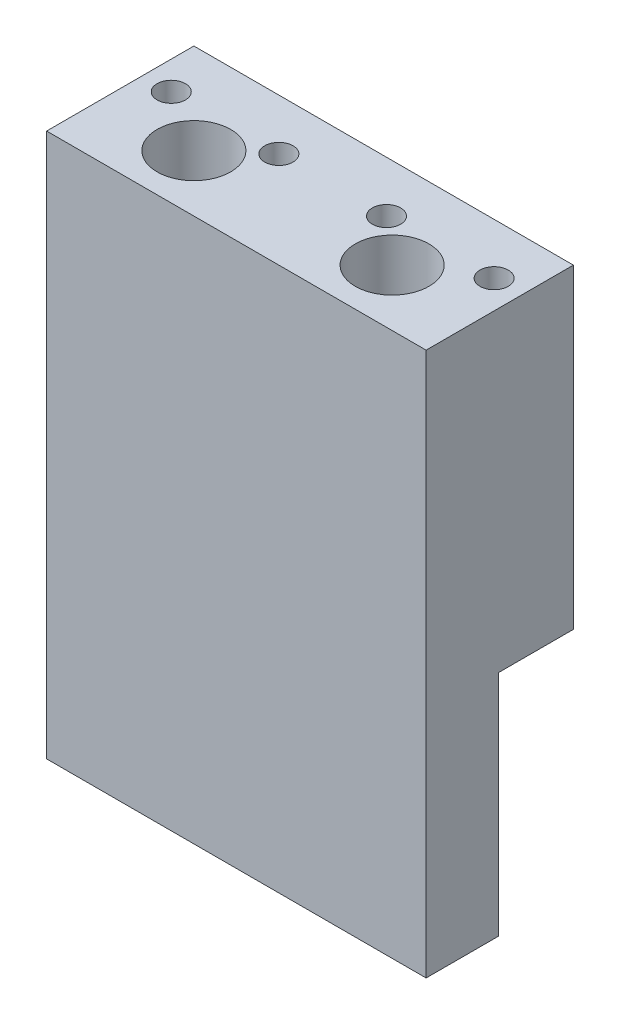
ISO-10303-21;
HEADER;
FILE_DESCRIPTION(('STEP AP214'),'2;1');
FILE_NAME('part.step','',(''),(''),'','','');
FILE_SCHEMA(('AUTOMOTIVE_DESIGN { 1 0 10303 214 1 1 1 1 }'));
ENDSEC;
DATA;
#1=APPLICATION_CONTEXT('core data for automotive mechanical design processes');
#2=APPLICATION_PROTOCOL_DEFINITION('international standard','automotive_design',2000,#1);
#3=PRODUCT_CONTEXT('',#1,'mechanical');
#4=PRODUCT('Part','Part','',(#3));
#5=PRODUCT_RELATED_PRODUCT_CATEGORY('part','',(#4));
#6=PRODUCT_DEFINITION_FORMATION('','',#4);
#7=PRODUCT_DEFINITION_CONTEXT('part definition',#1,'design');
#8=PRODUCT_DEFINITION('design','',#6,#7);
#9=PRODUCT_DEFINITION_SHAPE('','',#8);
#10=(LENGTH_UNIT() NAMED_UNIT(*) SI_UNIT(.MILLI.,.METRE.));
#11=(NAMED_UNIT(*) PLANE_ANGLE_UNIT() SI_UNIT($,.RADIAN.));
#12=(NAMED_UNIT(*) SI_UNIT($,.STERADIAN.) SOLID_ANGLE_UNIT());
#13=UNCERTAINTY_MEASURE_WITH_UNIT(LENGTH_MEASURE(1.E-05),#10,'distance_accuracy_value','');
#14=(GEOMETRIC_REPRESENTATION_CONTEXT(3) GLOBAL_UNCERTAINTY_ASSIGNED_CONTEXT((#13)) GLOBAL_UNIT_ASSIGNED_CONTEXT((#10,
#11,#12)) REPRESENTATION_CONTEXT('',''));
#15=CARTESIAN_POINT('',(0.,0.,0.));
#16=DIRECTION('',(0.,0.,1.));
#17=DIRECTION('',(1.,0.,0.));
#18=AXIS2_PLACEMENT_3D('',#15,#16,#17);
#19=CARTESIAN_POINT('',(2.50249999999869,-1.11022302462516E-13,4.5));
#20=DIRECTION('',(0.,1.,0.));
#21=DIRECTION('',(0.,0.,1.));
#22=AXIS2_PLACEMENT_3D('',#19,#20,#21);
#23=CYLINDRICAL_SURFACE('',#22,0.75);
#24=CARTESIAN_POINT('',(2.50249999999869,22.150000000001,4.5));
#25=DIRECTION('',(0.,-1.,0.));
#26=DIRECTION('',(0.,0.,-1.));
#27=AXIS2_PLACEMENT_3D('',#24,#25,#26);
#28=CIRCLE('',#27,0.75);
#29=CARTESIAN_POINT('',(2.50249999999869,22.150000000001,3.75));
#30=VERTEX_POINT('',#29);
#31=EDGE_CURVE('E477',#30,#30,#28,.T.);
#32=ORIENTED_EDGE('',*,*,#31,.T.);
#33=EDGE_LOOP('',(#32));
#34=FACE_BOUND('',#33,.T.);
#35=CARTESIAN_POINT('',(2.50249999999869,37.,4.5));
#36=DIRECTION('',(0.,1.,0.));
#37=DIRECTION('',(0.,0.,1.));
#38=AXIS2_PLACEMENT_3D('',#35,#36,#37);
#39=CIRCLE('',#38,0.75);
#40=CARTESIAN_POINT('',(2.50249999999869,37.,5.25));
#41=VERTEX_POINT('',#40);
#42=EDGE_CURVE('E37',#41,#41,#39,.F.);
#43=ORIENTED_EDGE('',*,*,#42,.F.);
#44=EDGE_LOOP('',(#43));
#45=FACE_BOUND('',#44,.T.);
#46=ADVANCED_FACE('F33',(#34,#45),#23,.F.);
#47=CARTESIAN_POINT('',(12.0024999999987,-1.11022302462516E-13,4.5));
#48=DIRECTION('',(0.,1.,0.));
#49=DIRECTION('',(0.,0.,1.));
#50=AXIS2_PLACEMENT_3D('',#47,#48,#49);
#51=CYLINDRICAL_SURFACE('',#50,0.750000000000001);
#52=CARTESIAN_POINT('',(12.0024999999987,22.150000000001,4.5));
#53=DIRECTION('',(0.,-1.,0.));
#54=DIRECTION('',(0.,0.,-1.));
#55=AXIS2_PLACEMENT_3D('',#52,#53,#54);
#56=CIRCLE('',#55,0.750000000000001);
#57=CARTESIAN_POINT('',(12.0024999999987,22.150000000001,3.75));
#58=VERTEX_POINT('',#57);
#59=EDGE_CURVE('E480',#58,#58,#56,.T.);
#60=ORIENTED_EDGE('',*,*,#59,.T.);
#61=EDGE_LOOP('',(#60));
#62=FACE_BOUND('',#61,.T.);
#63=CARTESIAN_POINT('',(12.0024999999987,37.,4.5));
#64=DIRECTION('',(0.,1.,0.));
#65=DIRECTION('',(0.,0.,1.));
#66=AXIS2_PLACEMENT_3D('',#63,#64,#65);
#67=CIRCLE('',#66,0.750000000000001);
#68=CARTESIAN_POINT('',(12.0024999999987,37.,5.25));
#69=VERTEX_POINT('',#68);
#70=EDGE_CURVE('E893',#69,#69,#67,.F.);
#71=ORIENTED_EDGE('',*,*,#70,.F.);
#72=EDGE_LOOP('',(#71));
#73=FACE_BOUND('',#72,.T.);
#74=ADVANCED_FACE('F940',(#62,#73),#51,.F.);
#75=CARTESIAN_POINT('',(21.5024999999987,-1.11022302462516E-13,4.5));
#76=DIRECTION('',(0.,1.,0.));
#77=DIRECTION('',(0.,0.,1.));
#78=AXIS2_PLACEMENT_3D('',#75,#76,#77);
#79=CYLINDRICAL_SURFACE('',#78,0.750000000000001);
#80=CARTESIAN_POINT('',(21.5024999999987,22.150000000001,4.5));
#81=DIRECTION('',(0.,-1.,0.));
#82=DIRECTION('',(0.,0.,-1.));
#83=AXIS2_PLACEMENT_3D('',#80,#81,#82);
#84=CIRCLE('',#83,0.750000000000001);
#85=CARTESIAN_POINT('',(21.5024999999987,22.150000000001,3.75));
#86=VERTEX_POINT('',#85);
#87=EDGE_CURVE('E879',#86,#86,#84,.T.);
#88=ORIENTED_EDGE('',*,*,#87,.T.);
#89=EDGE_LOOP('',(#88));
#90=FACE_BOUND('',#89,.T.);
#91=CARTESIAN_POINT('',(21.5024999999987,37.,4.5));
#92=DIRECTION('',(0.,1.,0.));
#93=DIRECTION('',(0.,0.,1.));
#94=AXIS2_PLACEMENT_3D('',#91,#92,#93);
#95=CIRCLE('',#94,0.750000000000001);
#96=CARTESIAN_POINT('',(21.5024999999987,37.,5.25));
#97=VERTEX_POINT('',#96);
#98=EDGE_CURVE('E889',#97,#97,#95,.F.);
#99=ORIENTED_EDGE('',*,*,#98,.F.);
#100=EDGE_LOOP('',(#99));
#101=FACE_BOUND('',#100,.T.);
#102=ADVANCED_FACE('F946',(#90,#101),#79,.F.);
#103=CARTESIAN_POINT('',(31.0024999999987,-1.11022302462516E-13,4.5));
#104=DIRECTION('',(0.,1.,0.));
#105=DIRECTION('',(0.,0.,1.));
#106=AXIS2_PLACEMENT_3D('',#103,#104,#105);
#107=CYLINDRICAL_SURFACE('',#106,0.750000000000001);
#108=CARTESIAN_POINT('',(31.0024999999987,22.150000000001,4.5));
#109=DIRECTION('',(0.,-1.,0.));
#110=DIRECTION('',(0.,0.,-1.));
#111=AXIS2_PLACEMENT_3D('',#108,#109,#110);
#112=CIRCLE('',#111,0.750000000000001);
#113=CARTESIAN_POINT('',(31.0024999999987,22.150000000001,3.75));
#114=VERTEX_POINT('',#113);
#115=EDGE_CURVE('E882',#114,#114,#112,.T.);
#116=ORIENTED_EDGE('',*,*,#115,.T.);
#117=EDGE_LOOP('',(#116));
#118=FACE_BOUND('',#117,.T.);
#119=CARTESIAN_POINT('',(31.0024999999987,37.,4.5));
#120=DIRECTION('',(0.,1.,0.));
#121=DIRECTION('',(0.,0.,1.));
#122=AXIS2_PLACEMENT_3D('',#119,#120,#121);
#123=CIRCLE('',#122,0.750000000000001);
#124=CARTESIAN_POINT('',(31.0024999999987,37.,5.25));
#125=VERTEX_POINT('',#124);
#126=EDGE_CURVE('E885',#125,#125,#123,.F.);
#127=ORIENTED_EDGE('',*,*,#126,.F.);
#128=EDGE_LOOP('',(#127));
#129=FACE_BOUND('',#128,.T.);
#130=ADVANCED_FACE('F1307',(#118,#129),#107,.F.);
#131=CARTESIAN_POINT('',(0.,2.,13.));
#132=DIRECTION('',(1.,0.,0.));
#133=DIRECTION('',(0.,0.,-1.));
#134=AXIS2_PLACEMENT_3D('',#131,#132,#133);
#135=PLANE('',#134);
#136=DIRECTION('',(0.,0.,-1.));
#137=VECTOR('',#136,1.);
#138=CARTESIAN_POINT('',(0.,22.150000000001,6.60000000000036));
#139=LINE('',#138,#137);
#140=CARTESIAN_POINT('',(0.,22.150000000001,6.60000000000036));
#141=VERTEX_POINT('',#140);
#142=CARTESIAN_POINT('',(0.,22.150000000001,0.));
#143=VERTEX_POINT('',#142);
#144=EDGE_CURVE('E50',#141,#143,#139,.T.);
#145=ORIENTED_EDGE('',*,*,#144,.F.);
#146=DIRECTION('',(0.,1.,0.));
#147=VECTOR('',#146,1.);
#148=CARTESIAN_POINT('',(0.,-1.13686837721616E-13,6.60000000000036));
#149=LINE('',#148,#147);
#150=CARTESIAN_POINT('',(0.,2.,6.60000000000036));
#151=VERTEX_POINT('',#150);
#152=EDGE_CURVE('E464',#151,#141,#149,.T.);
#153=ORIENTED_EDGE('',*,*,#152,.F.);
#154=DIRECTION('',(0.,0.,-1.));
#155=VECTOR('',#154,1.);
#156=CARTESIAN_POINT('',(0.,2.,13.));
#157=LINE('',#156,#155);
#158=CARTESIAN_POINT('',(0.,2.,13.));
#159=VERTEX_POINT('',#158);
#160=EDGE_CURVE('E12',#159,#151,#157,.T.);
#161=ORIENTED_EDGE('',*,*,#160,.F.);
#162=DIRECTION('',(0.,-1.,0.));
#163=VECTOR('',#162,1.);
#164=CARTESIAN_POINT('',(0.,2.,13.));
#165=LINE('',#164,#163);
#166=CARTESIAN_POINT('',(0.,50.,13.));
#167=VERTEX_POINT('',#166);
#168=EDGE_CURVE('E682',#167,#159,#165,.T.);
#169=ORIENTED_EDGE('',*,*,#168,.F.);
#170=DIRECTION('',(0.,0.,-1.));
#171=VECTOR('',#170,1.);
#172=CARTESIAN_POINT('',(0.,50.,13.));
#173=LINE('',#172,#171);
#174=CARTESIAN_POINT('',(0.,50.,0.));
#175=VERTEX_POINT('',#174);
#176=EDGE_CURVE('E688',#167,#175,#173,.T.);
#177=ORIENTED_EDGE('',*,*,#176,.T.);
#178=DIRECTION('',(0.,-1.,0.));
#179=VECTOR('',#178,1.);
#180=CARTESIAN_POINT('',(0.,2.,0.));
#181=LINE('',#180,#179);
#182=EDGE_CURVE('E681',#175,#143,#181,.T.);
#183=ORIENTED_EDGE('',*,*,#182,.T.);
#184=EDGE_LOOP('',(#145,#153,#161,#169,#177,#183));
#185=FACE_BOUND('',#184,.T.);
#186=ADVANCED_FACE('F35',(#185),#135,.F.);
#187=CARTESIAN_POINT('',(1.55249999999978,2.,13.));
#188=DIRECTION('',(1.,0.,0.));
#189=DIRECTION('',(0.,0.,-1.));
#190=AXIS2_PLACEMENT_3D('',#187,#188,#189);
#191=PLANE('',#190);
#192=DIRECTION('',(0.,-1.,0.));
#193=VECTOR('',#192,1.);
#194=CARTESIAN_POINT('',(1.55249999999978,2.,8.89999999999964));
#195=LINE('',#194,#193);
#196=CARTESIAN_POINT('',(1.55249999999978,1.99999999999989,8.89999999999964));
#197=VERTEX_POINT('',#196);
#198=CARTESIAN_POINT('',(1.55249999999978,0.500000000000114,8.89999999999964));
#199=VERTEX_POINT('',#198);
#200=EDGE_CURVE('E679',#197,#199,#195,.T.);
#201=ORIENTED_EDGE('',*,*,#200,.F.);
#202=DIRECTION('',(0.,0.,-1.));
#203=VECTOR('',#202,1.);
#204=CARTESIAN_POINT('',(1.55249999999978,2.,13.));
#205=LINE('',#204,#203);
#206=CARTESIAN_POINT('',(1.55249999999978,2.,6.60000000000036));
#207=VERTEX_POINT('',#206);
#208=EDGE_CURVE('E42',#197,#207,#205,.T.);
#209=ORIENTED_EDGE('',*,*,#208,.T.);
#210=DIRECTION('',(0.,1.,0.));
#211=VECTOR('',#210,1.);
#212=CARTESIAN_POINT('',(1.55249999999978,2.,6.60000000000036));
#213=LINE('',#212,#211);
#214=CARTESIAN_POINT('',(1.55249999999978,0.500000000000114,6.60000000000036));
#215=VERTEX_POINT('',#214);
#216=EDGE_CURVE('E597',#215,#207,#213,.T.);
#217=ORIENTED_EDGE('',*,*,#216,.F.);
#218=DIRECTION('',(0.,0.,-1.));
#219=VECTOR('',#218,1.);
#220=CARTESIAN_POINT('',(1.55249999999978,0.500000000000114,13.));
#221=LINE('',#220,#219);
#222=EDGE_CURVE('E872',#199,#215,#221,.T.);
#223=ORIENTED_EDGE('',*,*,#222,.F.);
#224=EDGE_LOOP('',(#201,#209,#217,#223));
#225=FACE_BOUND('',#224,.T.);
#226=ADVANCED_FACE('F977',(#225),#191,.F.);
#227=CARTESIAN_POINT('',(2.05249999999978,1.13686837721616E-13,13.));
#228=DIRECTION('',(0.707106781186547,0.707106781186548,0.));
#229=DIRECTION('',(-0.707106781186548,0.707106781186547,0.));
#230=AXIS2_PLACEMENT_3D('',#227,#228,#229);
#231=PLANE('',#230);
#232=DIRECTION('',(0.707106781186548,-0.707106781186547,0.));
#233=VECTOR('',#232,1.);
#234=CARTESIAN_POINT('',(2.05249999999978,1.13686837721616E-13,8.89999999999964));
#235=LINE('',#234,#233);
#236=CARTESIAN_POINT('',(2.05249999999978,-1.13686837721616E-13,8.89999999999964));
#237=VERTEX_POINT('',#236);
#238=EDGE_CURVE('E677',#199,#237,#235,.T.);
#239=ORIENTED_EDGE('',*,*,#238,.F.);
#240=ORIENTED_EDGE('',*,*,#222,.T.);
#241=DIRECTION('',(-0.707106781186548,0.707106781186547,0.));
#242=VECTOR('',#241,1.);
#243=CARTESIAN_POINT('',(2.05249999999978,1.13686837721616E-13,6.60000000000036));
#244=LINE('',#243,#242);
#245=CARTESIAN_POINT('',(2.05249999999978,-1.13686837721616E-13,6.60000000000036));
#246=VERTEX_POINT('',#245);
#247=EDGE_CURVE('E595',#246,#215,#244,.T.);
#248=ORIENTED_EDGE('',*,*,#247,.F.);
#249=DIRECTION('',(0.,0.,-1.));
#250=VECTOR('',#249,1.);
#251=CARTESIAN_POINT('',(2.05249999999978,1.13686837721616E-13,13.));
#252=LINE('',#251,#250);
#253=EDGE_CURVE('E869',#237,#246,#252,.T.);
#254=ORIENTED_EDGE('',*,*,#253,.F.);
#255=EDGE_LOOP('',(#239,#240,#248,#254));
#256=FACE_BOUND('',#255,.T.);
#257=ADVANCED_FACE('F980',(#256),#231,.F.);
#258=CARTESIAN_POINT('',(2.05249999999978,1.13686837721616E-13,13.));
#259=DIRECTION('',(0.,1.,0.));
#260=DIRECTION('',(0.,0.,1.));
#261=AXIS2_PLACEMENT_3D('',#258,#259,#260);
#262=PLANE('',#261);
#263=DIRECTION('',(1.,0.,0.));
#264=VECTOR('',#263,1.);
#265=CARTESIAN_POINT('',(0.,-1.13686837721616E-13,8.89999999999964));
#266=LINE('',#265,#264);
#267=CARTESIAN_POINT('',(2.95249999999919,-1.14089293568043E-13,8.89999999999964));
#268=VERTEX_POINT('',#267);
#269=EDGE_CURVE('E489',#237,#268,#266,.T.);
#270=ORIENTED_EDGE('',*,*,#269,.F.);
#271=ORIENTED_EDGE('',*,*,#253,.T.);
#272=DIRECTION('',(1.,0.,0.));
#273=VECTOR('',#272,1.);
#274=CARTESIAN_POINT('',(0.,-1.13686837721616E-13,6.60000000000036));
#275=LINE('',#274,#273);
#276=CARTESIAN_POINT('',(2.95249999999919,-1.14089293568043E-13,6.60000000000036));
#277=VERTEX_POINT('',#276);
#278=EDGE_CURVE('E466',#246,#277,#275,.T.);
#279=ORIENTED_EDGE('',*,*,#278,.T.);
#280=DIRECTION('',(0.,0.,-1.));
#281=VECTOR('',#280,1.);
#282=CARTESIAN_POINT('',(2.95249999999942,1.13686837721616E-13,13.));
#283=LINE('',#282,#281);
#284=EDGE_CURVE('E866',#268,#277,#283,.T.);
#285=ORIENTED_EDGE('',*,*,#284,.F.);
#286=EDGE_LOOP('',(#270,#271,#279,#285));
#287=FACE_BOUND('',#286,.T.);
#288=ADVANCED_FACE('F986',(#287),#262,.F.);
#289=CARTESIAN_POINT('',(2.95249999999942,1.13686837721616E-13,13.));
#290=DIRECTION('',(-0.707106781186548,0.707106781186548,0.));
#291=DIRECTION('',(-0.707106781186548,-0.707106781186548,0.));
#292=AXIS2_PLACEMENT_3D('',#289,#290,#291);
#293=PLANE('',#292);
#294=DIRECTION('',(0.707106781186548,0.707106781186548,0.));
#295=VECTOR('',#294,1.);
#296=CARTESIAN_POINT('',(2.95249999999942,1.13686837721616E-13,8.89999999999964));
#297=LINE('',#296,#295);
#298=CARTESIAN_POINT('',(3.45249999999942,0.500000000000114,8.89999999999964));
#299=VERTEX_POINT('',#298);
#300=EDGE_CURVE('E675',#268,#299,#297,.T.);
#301=ORIENTED_EDGE('',*,*,#300,.F.);
#302=ORIENTED_EDGE('',*,*,#284,.T.);
#303=DIRECTION('',(-0.707106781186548,-0.707106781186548,0.));
#304=VECTOR('',#303,1.);
#305=CARTESIAN_POINT('',(2.95249999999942,1.13686837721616E-13,6.60000000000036));
#306=LINE('',#305,#304);
#307=CARTESIAN_POINT('',(3.45249999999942,0.500000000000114,6.60000000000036));
#308=VERTEX_POINT('',#307);
#309=EDGE_CURVE('E593',#308,#277,#306,.T.);
#310=ORIENTED_EDGE('',*,*,#309,.F.);
#311=DIRECTION('',(0.,0.,-1.));
#312=VECTOR('',#311,1.);
#313=CARTESIAN_POINT('',(3.45249999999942,0.500000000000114,13.));
#314=LINE('',#313,#312);
#315=EDGE_CURVE('E863',#299,#308,#314,.T.);
#316=ORIENTED_EDGE('',*,*,#315,.F.);
#317=EDGE_LOOP('',(#301,#302,#310,#316));
#318=FACE_BOUND('',#317,.T.);
#319=ADVANCED_FACE('F1062',(#318),#293,.F.);
#320=CARTESIAN_POINT('',(3.45249999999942,2.,13.));
#321=DIRECTION('',(-1.,0.,0.));
#322=DIRECTION('',(0.,0.,1.));
#323=AXIS2_PLACEMENT_3D('',#320,#321,#322);
#324=PLANE('',#323);
#325=DIRECTION('',(0.,1.,0.));
#326=VECTOR('',#325,1.);
#327=CARTESIAN_POINT('',(3.45249999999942,2.,8.89999999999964));
#328=LINE('',#327,#326);
#329=CARTESIAN_POINT('',(3.45249999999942,1.99999999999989,8.89999999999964));
#330=VERTEX_POINT('',#329);
#331=EDGE_CURVE('E673',#299,#330,#328,.T.);
#332=ORIENTED_EDGE('',*,*,#331,.F.);
#333=ORIENTED_EDGE('',*,*,#315,.T.);
#334=DIRECTION('',(0.,-1.,0.));
#335=VECTOR('',#334,1.);
#336=CARTESIAN_POINT('',(3.45249999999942,2.,6.60000000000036));
#337=LINE('',#336,#335);
#338=CARTESIAN_POINT('',(3.45249999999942,2.,6.60000000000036));
#339=VERTEX_POINT('',#338);
#340=EDGE_CURVE('E591',#339,#308,#337,.T.);
#341=ORIENTED_EDGE('',*,*,#340,.F.);
#342=DIRECTION('',(0.,0.,-1.));
#343=VECTOR('',#342,1.);
#344=CARTESIAN_POINT('',(3.45249999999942,2.,13.));
#345=LINE('',#344,#343);
#346=EDGE_CURVE('E860',#330,#339,#345,.T.);
#347=ORIENTED_EDGE('',*,*,#346,.F.);
#348=EDGE_LOOP('',(#332,#333,#341,#347));
#349=FACE_BOUND('',#348,.T.);
#350=ADVANCED_FACE('F1068',(#349),#324,.F.);
#351=CARTESIAN_POINT('',(4.05249999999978,2.,13.));
#352=DIRECTION('',(1.,0.,0.));
#353=DIRECTION('',(0.,0.,-1.));
#354=AXIS2_PLACEMENT_3D('',#351,#352,#353);
#355=PLANE('',#354);
#356=DIRECTION('',(0.,-1.,0.));
#357=VECTOR('',#356,1.);
#358=CARTESIAN_POINT('',(4.05249999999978,2.,8.89999999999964));
#359=LINE('',#358,#357);
#360=CARTESIAN_POINT('',(4.05249999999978,1.99999999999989,8.89999999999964));
#361=VERTEX_POINT('',#360);
#362=CARTESIAN_POINT('',(4.05249999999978,0.500000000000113,8.89999999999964));
#363=VERTEX_POINT('',#362);
#364=EDGE_CURVE('E671',#361,#363,#359,.T.);
#365=ORIENTED_EDGE('',*,*,#364,.F.);
#366=DIRECTION('',(0.,0.,-1.));
#367=VECTOR('',#366,1.);
#368=CARTESIAN_POINT('',(4.05249999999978,2.,13.));
#369=LINE('',#368,#367);
#370=CARTESIAN_POINT('',(4.05249999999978,2.,6.60000000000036));
#371=VERTEX_POINT('',#370);
#372=EDGE_CURVE('E857',#361,#371,#369,.T.);
#373=ORIENTED_EDGE('',*,*,#372,.T.);
#374=DIRECTION('',(0.,1.,0.));
#375=VECTOR('',#374,1.);
#376=CARTESIAN_POINT('',(4.05249999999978,2.,6.60000000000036));
#377=LINE('',#376,#375);
#378=CARTESIAN_POINT('',(4.05249999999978,0.500000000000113,6.60000000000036));
#379=VERTEX_POINT('',#378);
#380=EDGE_CURVE('E587',#379,#371,#377,.T.);
#381=ORIENTED_EDGE('',*,*,#380,.F.);
#382=DIRECTION('',(0.,0.,-1.));
#383=VECTOR('',#382,1.);
#384=CARTESIAN_POINT('',(4.05249999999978,0.500000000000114,13.));
#385=LINE('',#384,#383);
#386=EDGE_CURVE('E854',#363,#379,#385,.T.);
#387=ORIENTED_EDGE('',*,*,#386,.F.);
#388=EDGE_LOOP('',(#365,#373,#381,#387));
#389=FACE_BOUND('',#388,.T.);
#390=ADVANCED_FACE('F1291',(#389),#355,.F.);
#391=CARTESIAN_POINT('',(4.55249999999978,1.13686837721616E-13,13.));
#392=DIRECTION('',(0.707106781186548,0.707106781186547,0.));
#393=DIRECTION('',(-0.707106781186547,0.707106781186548,0.));
#394=AXIS2_PLACEMENT_3D('',#391,#392,#393);
#395=PLANE('',#394);
#396=DIRECTION('',(0.707106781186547,-0.707106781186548,0.));
#397=VECTOR('',#396,1.);
#398=CARTESIAN_POINT('',(4.55249999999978,1.13686837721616E-13,8.89999999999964));
#399=LINE('',#398,#397);
#400=CARTESIAN_POINT('',(4.55249999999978,-1.13686837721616E-13,8.89999999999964));
#401=VERTEX_POINT('',#400);
#402=EDGE_CURVE('E669',#363,#401,#399,.T.);
#403=ORIENTED_EDGE('',*,*,#402,.F.);
#404=ORIENTED_EDGE('',*,*,#386,.T.);
#405=DIRECTION('',(-0.707106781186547,0.707106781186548,0.));
#406=VECTOR('',#405,1.);
#407=CARTESIAN_POINT('',(4.55249999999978,1.13686837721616E-13,6.60000000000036));
#408=LINE('',#407,#406);
#409=CARTESIAN_POINT('',(4.55249999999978,-1.13686837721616E-13,6.60000000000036));
#410=VERTEX_POINT('',#409);
#411=EDGE_CURVE('E585',#410,#379,#408,.T.);
#412=ORIENTED_EDGE('',*,*,#411,.F.);
#413=DIRECTION('',(0.,0.,-1.));
#414=VECTOR('',#413,1.);
#415=CARTESIAN_POINT('',(4.55249999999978,1.13686837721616E-13,13.));
#416=LINE('',#415,#414);
#417=EDGE_CURVE('E851',#401,#410,#416,.T.);
#418=ORIENTED_EDGE('',*,*,#417,.F.);
#419=EDGE_LOOP('',(#403,#404,#412,#418));
#420=FACE_BOUND('',#419,.T.);
#421=ADVANCED_FACE('F1288',(#420),#395,.F.);
#422=CARTESIAN_POINT('',(4.55249999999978,1.13686837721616E-13,13.));
#423=DIRECTION('',(0.,1.,0.));
#424=DIRECTION('',(0.,0.,1.));
#425=AXIS2_PLACEMENT_3D('',#422,#423,#424);
#426=PLANE('',#425);
#427=CARTESIAN_POINT('',(5.45249999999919,-1.14089293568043E-13,8.89999999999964));
#428=VERTEX_POINT('',#427);
#429=EDGE_CURVE('E988',#401,#428,#266,.T.);
#430=ORIENTED_EDGE('',*,*,#429,.F.);
#431=ORIENTED_EDGE('',*,*,#417,.T.);
#432=CARTESIAN_POINT('',(5.45249999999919,-1.14089293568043E-13,6.60000000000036));
#433=VERTEX_POINT('',#432);
#434=EDGE_CURVE('E1054',#410,#433,#275,.T.);
#435=ORIENTED_EDGE('',*,*,#434,.T.);
#436=DIRECTION('',(0.,0.,-1.));
#437=VECTOR('',#436,1.);
#438=CARTESIAN_POINT('',(5.45249999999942,1.13686837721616E-13,13.));
#439=LINE('',#438,#437);
#440=EDGE_CURVE('E848',#428,#433,#439,.T.);
#441=ORIENTED_EDGE('',*,*,#440,.F.);
#442=EDGE_LOOP('',(#430,#431,#435,#441));
#443=FACE_BOUND('',#442,.T.);
#444=ADVANCED_FACE('F1284',(#443),#426,.F.);
#445=CARTESIAN_POINT('',(5.45249999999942,1.13686837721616E-13,13.));
#446=DIRECTION('',(-0.707106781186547,0.707106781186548,0.));
#447=DIRECTION('',(-0.707106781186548,-0.707106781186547,0.));
#448=AXIS2_PLACEMENT_3D('',#445,#446,#447);
#449=PLANE('',#448);
#450=DIRECTION('',(0.707106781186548,0.707106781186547,0.));
#451=VECTOR('',#450,1.);
#452=CARTESIAN_POINT('',(5.45249999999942,1.13686837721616E-13,8.89999999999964));
#453=LINE('',#452,#451);
#454=CARTESIAN_POINT('',(5.95249999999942,0.500000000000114,8.89999999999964));
#455=VERTEX_POINT('',#454);
#456=EDGE_CURVE('E667',#428,#455,#453,.T.);
#457=ORIENTED_EDGE('',*,*,#456,.F.);
#458=ORIENTED_EDGE('',*,*,#440,.T.);
#459=DIRECTION('',(-0.707106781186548,-0.707106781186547,0.));
#460=VECTOR('',#459,1.);
#461=CARTESIAN_POINT('',(5.45249999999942,1.13686837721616E-13,6.60000000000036));
#462=LINE('',#461,#460);
#463=CARTESIAN_POINT('',(5.95249999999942,0.500000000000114,6.60000000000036));
#464=VERTEX_POINT('',#463);
#465=EDGE_CURVE('E583',#464,#433,#462,.T.);
#466=ORIENTED_EDGE('',*,*,#465,.F.);
#467=DIRECTION('',(0.,0.,-1.));
#468=VECTOR('',#467,1.);
#469=CARTESIAN_POINT('',(5.95249999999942,0.500000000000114,13.));
#470=LINE('',#469,#468);
#471=EDGE_CURVE('E845',#455,#464,#470,.T.);
#472=ORIENTED_EDGE('',*,*,#471,.F.);
#473=EDGE_LOOP('',(#457,#458,#466,#472));
#474=FACE_BOUND('',#473,.T.);
#475=ADVANCED_FACE('F1280',(#474),#449,.F.);
#476=CARTESIAN_POINT('',(5.95249999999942,2.,13.));
#477=DIRECTION('',(-1.,0.,0.));
#478=DIRECTION('',(0.,0.,1.));
#479=AXIS2_PLACEMENT_3D('',#476,#477,#478);
#480=PLANE('',#479);
#481=DIRECTION('',(0.,1.,0.));
#482=VECTOR('',#481,1.);
#483=CARTESIAN_POINT('',(5.95249999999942,2.,8.89999999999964));
#484=LINE('',#483,#482);
#485=CARTESIAN_POINT('',(5.95249999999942,1.99999999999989,8.89999999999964));
#486=VERTEX_POINT('',#485);
#487=EDGE_CURVE('E665',#455,#486,#484,.T.);
#488=ORIENTED_EDGE('',*,*,#487,.F.);
#489=ORIENTED_EDGE('',*,*,#471,.T.);
#490=DIRECTION('',(0.,-1.,0.));
#491=VECTOR('',#490,1.);
#492=CARTESIAN_POINT('',(5.95249999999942,2.,6.60000000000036));
#493=LINE('',#492,#491);
#494=CARTESIAN_POINT('',(5.95249999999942,2.,6.60000000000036));
#495=VERTEX_POINT('',#494);
#496=EDGE_CURVE('E581',#495,#464,#493,.T.);
#497=ORIENTED_EDGE('',*,*,#496,.F.);
#498=DIRECTION('',(0.,0.,-1.));
#499=VECTOR('',#498,1.);
#500=CARTESIAN_POINT('',(5.95249999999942,2.,13.));
#501=LINE('',#500,#499);
#502=EDGE_CURVE('E842',#486,#495,#501,.T.);
#503=ORIENTED_EDGE('',*,*,#502,.F.);
#504=EDGE_LOOP('',(#488,#489,#497,#503));
#505=FACE_BOUND('',#504,.T.);
#506=ADVANCED_FACE('F1276',(#505),#480,.F.);
#507=CARTESIAN_POINT('',(6.55249999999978,2.,13.));
#508=DIRECTION('',(1.,0.,0.));
#509=DIRECTION('',(0.,0.,-1.));
#510=AXIS2_PLACEMENT_3D('',#507,#508,#509);
#511=PLANE('',#510);
#512=DIRECTION('',(0.,-1.,0.));
#513=VECTOR('',#512,1.);
#514=CARTESIAN_POINT('',(6.55249999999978,2.,8.89999999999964));
#515=LINE('',#514,#513);
#516=CARTESIAN_POINT('',(6.55249999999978,1.99999999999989,8.89999999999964));
#517=VERTEX_POINT('',#516);
#518=CARTESIAN_POINT('',(6.55249999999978,0.500000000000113,8.89999999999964));
#519=VERTEX_POINT('',#518);
#520=EDGE_CURVE('E663',#517,#519,#515,.T.);
#521=ORIENTED_EDGE('',*,*,#520,.F.);
#522=DIRECTION('',(0.,0.,-1.));
#523=VECTOR('',#522,1.);
#524=CARTESIAN_POINT('',(6.55249999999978,2.,13.));
#525=LINE('',#524,#523);
#526=CARTESIAN_POINT('',(6.55249999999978,2.,6.60000000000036));
#527=VERTEX_POINT('',#526);
#528=EDGE_CURVE('E839',#517,#527,#525,.T.);
#529=ORIENTED_EDGE('',*,*,#528,.T.);
#530=DIRECTION('',(0.,1.,0.));
#531=VECTOR('',#530,1.);
#532=CARTESIAN_POINT('',(6.55249999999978,2.,6.60000000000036));
#533=LINE('',#532,#531);
#534=CARTESIAN_POINT('',(6.55249999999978,0.500000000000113,6.60000000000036));
#535=VERTEX_POINT('',#534);
#536=EDGE_CURVE('E577',#535,#527,#533,.T.);
#537=ORIENTED_EDGE('',*,*,#536,.F.);
#538=DIRECTION('',(0.,0.,-1.));
#539=VECTOR('',#538,1.);
#540=CARTESIAN_POINT('',(6.55249999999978,0.500000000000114,13.));
#541=LINE('',#540,#539);
#542=EDGE_CURVE('E836',#519,#535,#541,.T.);
#543=ORIENTED_EDGE('',*,*,#542,.F.);
#544=EDGE_LOOP('',(#521,#529,#537,#543));
#545=FACE_BOUND('',#544,.T.);
#546=ADVANCED_FACE('F1272',(#545),#511,.F.);
#547=CARTESIAN_POINT('',(7.05249999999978,1.13686837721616E-13,13.));
#548=DIRECTION('',(0.707106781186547,0.707106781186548,0.));
#549=DIRECTION('',(-0.707106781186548,0.707106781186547,0.));
#550=AXIS2_PLACEMENT_3D('',#547,#548,#549);
#551=PLANE('',#550);
#552=DIRECTION('',(0.707106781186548,-0.707106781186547,0.));
#553=VECTOR('',#552,1.);
#554=CARTESIAN_POINT('',(7.05249999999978,1.13686837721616E-13,8.89999999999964));
#555=LINE('',#554,#553);
#556=CARTESIAN_POINT('',(7.05249999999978,-1.13686837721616E-13,8.89999999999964));
#557=VERTEX_POINT('',#556);
#558=EDGE_CURVE('E661',#519,#557,#555,.T.);
#559=ORIENTED_EDGE('',*,*,#558,.F.);
#560=ORIENTED_EDGE('',*,*,#542,.T.);
#561=DIRECTION('',(-0.707106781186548,0.707106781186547,0.));
#562=VECTOR('',#561,1.);
#563=CARTESIAN_POINT('',(7.05249999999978,1.13686837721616E-13,6.60000000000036));
#564=LINE('',#563,#562);
#565=CARTESIAN_POINT('',(7.05249999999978,-1.13686837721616E-13,6.60000000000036));
#566=VERTEX_POINT('',#565);
#567=EDGE_CURVE('E575',#566,#535,#564,.T.);
#568=ORIENTED_EDGE('',*,*,#567,.F.);
#569=DIRECTION('',(0.,0.,-1.));
#570=VECTOR('',#569,1.);
#571=CARTESIAN_POINT('',(7.05249999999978,1.13686837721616E-13,13.));
#572=LINE('',#571,#570);
#573=EDGE_CURVE('E833',#557,#566,#572,.T.);
#574=ORIENTED_EDGE('',*,*,#573,.F.);
#575=EDGE_LOOP('',(#559,#560,#568,#574));
#576=FACE_BOUND('',#575,.T.);
#577=ADVANCED_FACE('F1269',(#576),#551,.F.);
#578=CARTESIAN_POINT('',(7.05249999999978,1.13686837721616E-13,13.));
#579=DIRECTION('',(0.,1.,0.));
#580=DIRECTION('',(0.,0.,1.));
#581=AXIS2_PLACEMENT_3D('',#578,#579,#580);
#582=PLANE('',#581);
#583=CARTESIAN_POINT('',(7.45249999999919,-1.14089293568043E-13,8.89999999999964));
#584=VERTEX_POINT('',#583);
#585=EDGE_CURVE('E989',#557,#584,#266,.T.);
#586=ORIENTED_EDGE('',*,*,#585,.F.);
#587=ORIENTED_EDGE('',*,*,#573,.T.);
#588=CARTESIAN_POINT('',(7.45249999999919,-1.14089293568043E-13,6.60000000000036));
#589=VERTEX_POINT('',#588);
#590=EDGE_CURVE('E1050',#566,#589,#275,.T.);
#591=ORIENTED_EDGE('',*,*,#590,.T.);
#592=DIRECTION('',(0.,0.,-1.));
#593=VECTOR('',#592,1.);
#594=CARTESIAN_POINT('',(7.45249999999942,1.13686837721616E-13,13.));
#595=LINE('',#594,#593);
#596=EDGE_CURVE('E830',#584,#589,#595,.T.);
#597=ORIENTED_EDGE('',*,*,#596,.F.);
#598=EDGE_LOOP('',(#586,#587,#591,#597));
#599=FACE_BOUND('',#598,.T.);
#600=ADVANCED_FACE('F1265',(#599),#582,.F.);
#601=CARTESIAN_POINT('',(7.45249999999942,1.13686837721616E-13,13.));
#602=DIRECTION('',(-0.707106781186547,0.707106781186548,0.));
#603=DIRECTION('',(-0.707106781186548,-0.707106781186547,0.));
#604=AXIS2_PLACEMENT_3D('',#601,#602,#603);
#605=PLANE('',#604);
#606=DIRECTION('',(0.707106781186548,0.707106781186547,0.));
#607=VECTOR('',#606,1.);
#608=CARTESIAN_POINT('',(7.45249999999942,1.13686837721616E-13,8.89999999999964));
#609=LINE('',#608,#607);
#610=CARTESIAN_POINT('',(7.95249999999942,0.500000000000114,8.89999999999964));
#611=VERTEX_POINT('',#610);
#612=EDGE_CURVE('E659',#584,#611,#609,.T.);
#613=ORIENTED_EDGE('',*,*,#612,.F.);
#614=ORIENTED_EDGE('',*,*,#596,.T.);
#615=DIRECTION('',(-0.707106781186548,-0.707106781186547,0.));
#616=VECTOR('',#615,1.);
#617=CARTESIAN_POINT('',(7.45249999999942,1.13686837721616E-13,6.60000000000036));
#618=LINE('',#617,#616);
#619=CARTESIAN_POINT('',(7.95249999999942,0.500000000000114,6.60000000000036));
#620=VERTEX_POINT('',#619);
#621=EDGE_CURVE('E573',#620,#589,#618,.T.);
#622=ORIENTED_EDGE('',*,*,#621,.F.);
#623=DIRECTION('',(0.,0.,-1.));
#624=VECTOR('',#623,1.);
#625=CARTESIAN_POINT('',(7.95249999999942,0.500000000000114,13.));
#626=LINE('',#625,#624);
#627=EDGE_CURVE('E827',#611,#620,#626,.T.);
#628=ORIENTED_EDGE('',*,*,#627,.F.);
#629=EDGE_LOOP('',(#613,#614,#622,#628));
#630=FACE_BOUND('',#629,.T.);
#631=ADVANCED_FACE('F1261',(#630),#605,.F.);
#632=CARTESIAN_POINT('',(7.95249999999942,2.,13.));
#633=DIRECTION('',(-1.,0.,0.));
#634=DIRECTION('',(0.,0.,1.));
#635=AXIS2_PLACEMENT_3D('',#632,#633,#634);
#636=PLANE('',#635);
#637=DIRECTION('',(0.,1.,0.));
#638=VECTOR('',#637,1.);
#639=CARTESIAN_POINT('',(7.95249999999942,2.,8.89999999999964));
#640=LINE('',#639,#638);
#641=CARTESIAN_POINT('',(7.95249999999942,1.99999999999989,8.89999999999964));
#642=VERTEX_POINT('',#641);
#643=EDGE_CURVE('E657',#611,#642,#640,.T.);
#644=ORIENTED_EDGE('',*,*,#643,.F.);
#645=ORIENTED_EDGE('',*,*,#627,.T.);
#646=DIRECTION('',(0.,-1.,0.));
#647=VECTOR('',#646,1.);
#648=CARTESIAN_POINT('',(7.95249999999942,2.,6.60000000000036));
#649=LINE('',#648,#647);
#650=CARTESIAN_POINT('',(7.95249999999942,2.,6.60000000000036));
#651=VERTEX_POINT('',#650);
#652=EDGE_CURVE('E571',#651,#620,#649,.T.);
#653=ORIENTED_EDGE('',*,*,#652,.F.);
#654=DIRECTION('',(0.,0.,-1.));
#655=VECTOR('',#654,1.);
#656=CARTESIAN_POINT('',(7.95249999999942,2.,13.));
#657=LINE('',#656,#655);
#658=EDGE_CURVE('E824',#642,#651,#657,.T.);
#659=ORIENTED_EDGE('',*,*,#658,.F.);
#660=EDGE_LOOP('',(#644,#645,#653,#659));
#661=FACE_BOUND('',#660,.T.);
#662=ADVANCED_FACE('F1257',(#661),#636,.F.);
#663=CARTESIAN_POINT('',(8.55249999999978,2.,13.));
#664=DIRECTION('',(1.,0.,0.));
#665=DIRECTION('',(0.,0.,-1.));
#666=AXIS2_PLACEMENT_3D('',#663,#664,#665);
#667=PLANE('',#666);
#668=DIRECTION('',(0.,-1.,0.));
#669=VECTOR('',#668,1.);
#670=CARTESIAN_POINT('',(8.55249999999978,2.,8.89999999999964));
#671=LINE('',#670,#669);
#672=CARTESIAN_POINT('',(8.55249999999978,1.99999999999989,8.89999999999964));
#673=VERTEX_POINT('',#672);
#674=CARTESIAN_POINT('',(8.55249999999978,0.500000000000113,8.89999999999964));
#675=VERTEX_POINT('',#674);
#676=EDGE_CURVE('E655',#673,#675,#671,.T.);
#677=ORIENTED_EDGE('',*,*,#676,.F.);
#678=DIRECTION('',(0.,0.,-1.));
#679=VECTOR('',#678,1.);
#680=CARTESIAN_POINT('',(8.55249999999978,2.,13.));
#681=LINE('',#680,#679);
#682=CARTESIAN_POINT('',(8.55249999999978,2.,6.60000000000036));
#683=VERTEX_POINT('',#682);
#684=EDGE_CURVE('E821',#673,#683,#681,.T.);
#685=ORIENTED_EDGE('',*,*,#684,.T.);
#686=DIRECTION('',(0.,1.,0.));
#687=VECTOR('',#686,1.);
#688=CARTESIAN_POINT('',(8.55249999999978,2.,6.60000000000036));
#689=LINE('',#688,#687);
#690=CARTESIAN_POINT('',(8.55249999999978,0.500000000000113,6.60000000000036));
#691=VERTEX_POINT('',#690);
#692=EDGE_CURVE('E567',#691,#683,#689,.T.);
#693=ORIENTED_EDGE('',*,*,#692,.F.);
#694=DIRECTION('',(0.,0.,-1.));
#695=VECTOR('',#694,1.);
#696=CARTESIAN_POINT('',(8.55249999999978,0.500000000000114,13.));
#697=LINE('',#696,#695);
#698=EDGE_CURVE('E818',#675,#691,#697,.T.);
#699=ORIENTED_EDGE('',*,*,#698,.F.);
#700=EDGE_LOOP('',(#677,#685,#693,#699));
#701=FACE_BOUND('',#700,.T.);
#702=ADVANCED_FACE('F1253',(#701),#667,.F.);
#703=CARTESIAN_POINT('',(9.05249999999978,1.13686837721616E-13,13.));
#704=DIRECTION('',(0.707106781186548,0.707106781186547,0.));
#705=DIRECTION('',(-0.707106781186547,0.707106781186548,0.));
#706=AXIS2_PLACEMENT_3D('',#703,#704,#705);
#707=PLANE('',#706);
#708=DIRECTION('',(0.707106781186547,-0.707106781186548,0.));
#709=VECTOR('',#708,1.);
#710=CARTESIAN_POINT('',(9.05249999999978,1.13686837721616E-13,8.89999999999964));
#711=LINE('',#710,#709);
#712=CARTESIAN_POINT('',(9.05249999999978,-1.13686837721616E-13,8.89999999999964));
#713=VERTEX_POINT('',#712);
#714=EDGE_CURVE('E653',#675,#713,#711,.T.);
#715=ORIENTED_EDGE('',*,*,#714,.F.);
#716=ORIENTED_EDGE('',*,*,#698,.T.);
#717=DIRECTION('',(-0.707106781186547,0.707106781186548,0.));
#718=VECTOR('',#717,1.);
#719=CARTESIAN_POINT('',(9.05249999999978,1.13686837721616E-13,6.60000000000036));
#720=LINE('',#719,#718);
#721=CARTESIAN_POINT('',(9.05249999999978,-1.13686837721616E-13,6.60000000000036));
#722=VERTEX_POINT('',#721);
#723=EDGE_CURVE('E565',#722,#691,#720,.T.);
#724=ORIENTED_EDGE('',*,*,#723,.F.);
#725=DIRECTION('',(0.,0.,-1.));
#726=VECTOR('',#725,1.);
#727=CARTESIAN_POINT('',(9.05249999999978,1.13686837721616E-13,13.));
#728=LINE('',#727,#726);
#729=EDGE_CURVE('E815',#713,#722,#728,.T.);
#730=ORIENTED_EDGE('',*,*,#729,.F.);
#731=EDGE_LOOP('',(#715,#716,#724,#730));
#732=FACE_BOUND('',#731,.T.);
#733=ADVANCED_FACE('F1250',(#732),#707,.F.);
#734=CARTESIAN_POINT('',(9.05249999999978,1.13686837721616E-13,13.));
#735=DIRECTION('',(0.,1.,0.));
#736=DIRECTION('',(0.,0.,1.));
#737=AXIS2_PLACEMENT_3D('',#734,#735,#736);
#738=PLANE('',#737);
#739=CARTESIAN_POINT('',(9.95249999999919,-1.14522974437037E-13,8.89999999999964));
#740=VERTEX_POINT('',#739);
#741=EDGE_CURVE('E993',#713,#740,#266,.T.);
#742=ORIENTED_EDGE('',*,*,#741,.F.);
#743=ORIENTED_EDGE('',*,*,#729,.T.);
#744=CARTESIAN_POINT('',(9.95249999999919,-1.14522974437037E-13,6.60000000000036));
#745=VERTEX_POINT('',#744);
#746=EDGE_CURVE('E1046',#722,#745,#275,.T.);
#747=ORIENTED_EDGE('',*,*,#746,.T.);
#748=DIRECTION('',(0.,0.,-1.));
#749=VECTOR('',#748,1.);
#750=CARTESIAN_POINT('',(9.95249999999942,1.13686837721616E-13,13.));
#751=LINE('',#750,#749);
#752=EDGE_CURVE('E812',#740,#745,#751,.T.);
#753=ORIENTED_EDGE('',*,*,#752,.F.);
#754=EDGE_LOOP('',(#742,#743,#747,#753));
#755=FACE_BOUND('',#754,.T.);
#756=ADVANCED_FACE('F1246',(#755),#738,.F.);
#757=CARTESIAN_POINT('',(9.95249999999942,1.13686837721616E-13,13.));
#758=DIRECTION('',(-0.707106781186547,0.707106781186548,0.));
#759=DIRECTION('',(-0.707106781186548,-0.707106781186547,0.));
#760=AXIS2_PLACEMENT_3D('',#757,#758,#759);
#761=PLANE('',#760);
#762=DIRECTION('',(0.707106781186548,0.707106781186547,0.));
#763=VECTOR('',#762,1.);
#764=CARTESIAN_POINT('',(9.95249999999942,1.13686837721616E-13,8.89999999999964));
#765=LINE('',#764,#763);
#766=CARTESIAN_POINT('',(10.4524999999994,0.500000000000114,8.89999999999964));
#767=VERTEX_POINT('',#766);
#768=EDGE_CURVE('E651',#740,#767,#765,.T.);
#769=ORIENTED_EDGE('',*,*,#768,.F.);
#770=ORIENTED_EDGE('',*,*,#752,.T.);
#771=DIRECTION('',(-0.707106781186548,-0.707106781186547,0.));
#772=VECTOR('',#771,1.);
#773=CARTESIAN_POINT('',(9.95249999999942,1.13686837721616E-13,6.60000000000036));
#774=LINE('',#773,#772);
#775=CARTESIAN_POINT('',(10.4524999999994,0.500000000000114,6.60000000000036));
#776=VERTEX_POINT('',#775);
#777=EDGE_CURVE('E563',#776,#745,#774,.T.);
#778=ORIENTED_EDGE('',*,*,#777,.F.);
#779=DIRECTION('',(0.,0.,-1.));
#780=VECTOR('',#779,1.);
#781=CARTESIAN_POINT('',(10.4524999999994,0.500000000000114,13.));
#782=LINE('',#781,#780);
#783=EDGE_CURVE('E809',#767,#776,#782,.T.);
#784=ORIENTED_EDGE('',*,*,#783,.F.);
#785=EDGE_LOOP('',(#769,#770,#778,#784));
#786=FACE_BOUND('',#785,.T.);
#787=ADVANCED_FACE('F1242',(#786),#761,.F.);
#788=CARTESIAN_POINT('',(10.4524999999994,2.,13.));
#789=DIRECTION('',(-1.,0.,0.));
#790=DIRECTION('',(0.,0.,1.));
#791=AXIS2_PLACEMENT_3D('',#788,#789,#790);
#792=PLANE('',#791);
#793=DIRECTION('',(0.,1.,0.));
#794=VECTOR('',#793,1.);
#795=CARTESIAN_POINT('',(10.4524999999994,2.,8.89999999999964));
#796=LINE('',#795,#794);
#797=CARTESIAN_POINT('',(10.4524999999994,1.99999999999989,8.89999999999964));
#798=VERTEX_POINT('',#797);
#799=EDGE_CURVE('E649',#767,#798,#796,.T.);
#800=ORIENTED_EDGE('',*,*,#799,.F.);
#801=ORIENTED_EDGE('',*,*,#783,.T.);
#802=DIRECTION('',(0.,-1.,0.));
#803=VECTOR('',#802,1.);
#804=CARTESIAN_POINT('',(10.4524999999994,2.,6.60000000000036));
#805=LINE('',#804,#803);
#806=CARTESIAN_POINT('',(10.4524999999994,2.,6.60000000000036));
#807=VERTEX_POINT('',#806);
#808=EDGE_CURVE('E561',#807,#776,#805,.T.);
#809=ORIENTED_EDGE('',*,*,#808,.F.);
#810=DIRECTION('',(0.,0.,-1.));
#811=VECTOR('',#810,1.);
#812=CARTESIAN_POINT('',(10.4524999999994,2.,13.));
#813=LINE('',#812,#811);
#814=EDGE_CURVE('E806',#798,#807,#813,.T.);
#815=ORIENTED_EDGE('',*,*,#814,.F.);
#816=EDGE_LOOP('',(#800,#801,#809,#815));
#817=FACE_BOUND('',#816,.T.);
#818=ADVANCED_FACE('F1238',(#817),#792,.F.);
#819=CARTESIAN_POINT('',(11.0524999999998,2.,13.));
#820=DIRECTION('',(1.,0.,0.));
#821=DIRECTION('',(0.,0.,-1.));
#822=AXIS2_PLACEMENT_3D('',#819,#820,#821);
#823=PLANE('',#822);
#824=DIRECTION('',(0.,-1.,0.));
#825=VECTOR('',#824,1.);
#826=CARTESIAN_POINT('',(11.0524999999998,2.,8.89999999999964));
#827=LINE('',#826,#825);
#828=CARTESIAN_POINT('',(11.0524999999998,1.99999999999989,8.89999999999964));
#829=VERTEX_POINT('',#828);
#830=CARTESIAN_POINT('',(11.0524999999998,0.500000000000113,8.89999999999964));
#831=VERTEX_POINT('',#830);
#832=EDGE_CURVE('E647',#829,#831,#827,.T.);
#833=ORIENTED_EDGE('',*,*,#832,.F.);
#834=DIRECTION('',(0.,0.,-1.));
#835=VECTOR('',#834,1.);
#836=CARTESIAN_POINT('',(11.0524999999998,2.,13.));
#837=LINE('',#836,#835);
#838=CARTESIAN_POINT('',(11.0524999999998,2.,6.60000000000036));
#839=VERTEX_POINT('',#838);
#840=EDGE_CURVE('E803',#829,#839,#837,.T.);
#841=ORIENTED_EDGE('',*,*,#840,.T.);
#842=DIRECTION('',(0.,1.,0.));
#843=VECTOR('',#842,1.);
#844=CARTESIAN_POINT('',(11.0524999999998,2.,6.60000000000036));
#845=LINE('',#844,#843);
#846=CARTESIAN_POINT('',(11.0524999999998,0.500000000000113,6.60000000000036));
#847=VERTEX_POINT('',#846);
#848=EDGE_CURVE('E557',#847,#839,#845,.T.);
#849=ORIENTED_EDGE('',*,*,#848,.F.);
#850=DIRECTION('',(0.,0.,-1.));
#851=VECTOR('',#850,1.);
#852=CARTESIAN_POINT('',(11.0524999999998,0.500000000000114,13.));
#853=LINE('',#852,#851);
#854=EDGE_CURVE('E800',#831,#847,#853,.T.);
#855=ORIENTED_EDGE('',*,*,#854,.F.);
#856=EDGE_LOOP('',(#833,#841,#849,#855));
#857=FACE_BOUND('',#856,.T.);
#858=ADVANCED_FACE('F1234',(#857),#823,.F.);
#859=CARTESIAN_POINT('',(11.5524999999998,1.13686837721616E-13,13.));
#860=DIRECTION('',(0.707106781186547,0.707106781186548,0.));
#861=DIRECTION('',(-0.707106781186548,0.707106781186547,0.));
#862=AXIS2_PLACEMENT_3D('',#859,#860,#861);
#863=PLANE('',#862);
#864=DIRECTION('',(0.707106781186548,-0.707106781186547,0.));
#865=VECTOR('',#864,1.);
#866=CARTESIAN_POINT('',(11.5524999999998,1.13686837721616E-13,8.89999999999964));
#867=LINE('',#866,#865);
#868=CARTESIAN_POINT('',(11.5524999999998,-1.13686837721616E-13,8.89999999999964));
#869=VERTEX_POINT('',#868);
#870=EDGE_CURVE('E645',#831,#869,#867,.T.);
#871=ORIENTED_EDGE('',*,*,#870,.F.);
#872=ORIENTED_EDGE('',*,*,#854,.T.);
#873=DIRECTION('',(-0.707106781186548,0.707106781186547,0.));
#874=VECTOR('',#873,1.);
#875=CARTESIAN_POINT('',(11.5524999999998,1.13686837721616E-13,6.60000000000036));
#876=LINE('',#875,#874);
#877=CARTESIAN_POINT('',(11.5524999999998,-1.13686837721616E-13,6.60000000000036));
#878=VERTEX_POINT('',#877);
#879=EDGE_CURVE('E555',#878,#847,#876,.T.);
#880=ORIENTED_EDGE('',*,*,#879,.F.);
#881=DIRECTION('',(0.,0.,-1.));
#882=VECTOR('',#881,1.);
#883=CARTESIAN_POINT('',(11.5524999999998,1.13686837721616E-13,13.));
#884=LINE('',#883,#882);
#885=EDGE_CURVE('E797',#869,#878,#884,.T.);
#886=ORIENTED_EDGE('',*,*,#885,.F.);
#887=EDGE_LOOP('',(#871,#872,#880,#886));
#888=FACE_BOUND('',#887,.T.);
#889=ADVANCED_FACE('F1231',(#888),#863,.F.);
#890=CARTESIAN_POINT('',(11.5524999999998,1.13686837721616E-13,13.));
#891=DIRECTION('',(0.,1.,0.));
#892=DIRECTION('',(0.,0.,1.));
#893=AXIS2_PLACEMENT_3D('',#890,#891,#892);
#894=PLANE('',#893);
#895=CARTESIAN_POINT('',(12.4524999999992,-1.13655612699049E-13,8.89999999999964));
#896=VERTEX_POINT('',#895);
#897=EDGE_CURVE('E997',#869,#896,#266,.T.);
#898=ORIENTED_EDGE('',*,*,#897,.F.);
#899=ORIENTED_EDGE('',*,*,#885,.T.);
#900=CARTESIAN_POINT('',(12.4524999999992,-1.13655612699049E-13,6.60000000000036));
#901=VERTEX_POINT('',#900);
#902=EDGE_CURVE('E1042',#878,#901,#275,.T.);
#903=ORIENTED_EDGE('',*,*,#902,.T.);
#904=DIRECTION('',(0.,0.,-1.));
#905=VECTOR('',#904,1.);
#906=CARTESIAN_POINT('',(12.4524999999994,1.13686837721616E-13,13.));
#907=LINE('',#906,#905);
#908=EDGE_CURVE('E794',#896,#901,#907,.T.);
#909=ORIENTED_EDGE('',*,*,#908,.F.);
#910=EDGE_LOOP('',(#898,#899,#903,#909));
#911=FACE_BOUND('',#910,.T.);
#912=ADVANCED_FACE('F1227',(#911),#894,.F.);
#913=CARTESIAN_POINT('',(12.4524999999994,1.13686837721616E-13,13.));
#914=DIRECTION('',(-0.707106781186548,0.707106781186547,0.));
#915=DIRECTION('',(-0.707106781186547,-0.707106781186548,0.));
#916=AXIS2_PLACEMENT_3D('',#913,#914,#915);
#917=PLANE('',#916);
#918=DIRECTION('',(0.707106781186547,0.707106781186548,0.));
#919=VECTOR('',#918,1.);
#920=CARTESIAN_POINT('',(12.4524999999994,1.13686837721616E-13,8.89999999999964));
#921=LINE('',#920,#919);
#922=CARTESIAN_POINT('',(12.9524999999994,0.500000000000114,8.89999999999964));
#923=VERTEX_POINT('',#922);
#924=EDGE_CURVE('E643',#896,#923,#921,.T.);
#925=ORIENTED_EDGE('',*,*,#924,.F.);
#926=ORIENTED_EDGE('',*,*,#908,.T.);
#927=DIRECTION('',(-0.707106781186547,-0.707106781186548,0.));
#928=VECTOR('',#927,1.);
#929=CARTESIAN_POINT('',(12.4524999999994,1.13686837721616E-13,6.60000000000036));
#930=LINE('',#929,#928);
#931=CARTESIAN_POINT('',(12.9524999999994,0.500000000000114,6.60000000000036));
#932=VERTEX_POINT('',#931);
#933=EDGE_CURVE('E553',#932,#901,#930,.T.);
#934=ORIENTED_EDGE('',*,*,#933,.F.);
#935=DIRECTION('',(0.,0.,-1.));
#936=VECTOR('',#935,1.);
#937=CARTESIAN_POINT('',(12.9524999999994,0.500000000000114,13.));
#938=LINE('',#937,#936);
#939=EDGE_CURVE('E791',#923,#932,#938,.T.);
#940=ORIENTED_EDGE('',*,*,#939,.F.);
#941=EDGE_LOOP('',(#925,#926,#934,#940));
#942=FACE_BOUND('',#941,.T.);
#943=ADVANCED_FACE('F1223',(#942),#917,.F.);
#944=CARTESIAN_POINT('',(12.9524999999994,2.,13.));
#945=DIRECTION('',(-1.,0.,0.));
#946=DIRECTION('',(0.,0.,1.));
#947=AXIS2_PLACEMENT_3D('',#944,#945,#946);
#948=PLANE('',#947);
#949=DIRECTION('',(0.,1.,0.));
#950=VECTOR('',#949,1.);
#951=CARTESIAN_POINT('',(12.9524999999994,2.,8.89999999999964));
#952=LINE('',#951,#950);
#953=CARTESIAN_POINT('',(12.9524999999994,1.99999999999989,8.89999999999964));
#954=VERTEX_POINT('',#953);
#955=EDGE_CURVE('E641',#923,#954,#952,.T.);
#956=ORIENTED_EDGE('',*,*,#955,.F.);
#957=ORIENTED_EDGE('',*,*,#939,.T.);
#958=DIRECTION('',(0.,-1.,0.));
#959=VECTOR('',#958,1.);
#960=CARTESIAN_POINT('',(12.9524999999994,2.,6.60000000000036));
#961=LINE('',#960,#959);
#962=CARTESIAN_POINT('',(12.9524999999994,2.,6.60000000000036));
#963=VERTEX_POINT('',#962);
#964=EDGE_CURVE('E551',#963,#932,#961,.T.);
#965=ORIENTED_EDGE('',*,*,#964,.F.);
#966=DIRECTION('',(0.,0.,-1.));
#967=VECTOR('',#966,1.);
#968=CARTESIAN_POINT('',(12.9524999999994,2.,13.));
#969=LINE('',#968,#967);
#970=EDGE_CURVE('E788',#954,#963,#969,.T.);
#971=ORIENTED_EDGE('',*,*,#970,.F.);
#972=EDGE_LOOP('',(#956,#957,#965,#971));
#973=FACE_BOUND('',#972,.T.);
#974=ADVANCED_FACE('F1219',(#973),#948,.F.);
#975=CARTESIAN_POINT('',(20.5524999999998,2.,13.));
#976=DIRECTION('',(1.,0.,0.));
#977=DIRECTION('',(0.,0.,-1.));
#978=AXIS2_PLACEMENT_3D('',#975,#976,#977);
#979=PLANE('',#978);
#980=DIRECTION('',(0.,-1.,0.));
#981=VECTOR('',#980,1.);
#982=CARTESIAN_POINT('',(20.5524999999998,2.,8.89999999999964));
#983=LINE('',#982,#981);
#984=CARTESIAN_POINT('',(20.5524999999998,1.99999999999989,8.89999999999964));
#985=VERTEX_POINT('',#984);
#986=CARTESIAN_POINT('',(20.5524999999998,0.500000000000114,8.89999999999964));
#987=VERTEX_POINT('',#986);
#988=EDGE_CURVE('E639',#985,#987,#983,.T.);
#989=ORIENTED_EDGE('',*,*,#988,.F.);
#990=DIRECTION('',(0.,0.,-1.));
#991=VECTOR('',#990,1.);
#992=CARTESIAN_POINT('',(20.5524999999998,2.,13.));
#993=LINE('',#992,#991);
#994=CARTESIAN_POINT('',(20.5524999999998,2.,6.60000000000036));
#995=VERTEX_POINT('',#994);
#996=EDGE_CURVE('E785',#985,#995,#993,.T.);
#997=ORIENTED_EDGE('',*,*,#996,.T.);
#998=DIRECTION('',(0.,1.,0.));
#999=VECTOR('',#998,1.);
#1000=CARTESIAN_POINT('',(20.5524999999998,2.,6.60000000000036));
#1001=LINE('',#1000,#999);
#1002=CARTESIAN_POINT('',(20.5524999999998,0.500000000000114,6.60000000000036));
#1003=VERTEX_POINT('',#1002);
#1004=EDGE_CURVE('E547',#1003,#995,#1001,.T.);
#1005=ORIENTED_EDGE('',*,*,#1004,.F.);
#1006=DIRECTION('',(0.,0.,-1.));
#1007=VECTOR('',#1006,1.);
#1008=CARTESIAN_POINT('',(20.5524999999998,0.500000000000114,13.));
#1009=LINE('',#1008,#1007);
#1010=EDGE_CURVE('E782',#987,#1003,#1009,.T.);
#1011=ORIENTED_EDGE('',*,*,#1010,.F.);
#1012=EDGE_LOOP('',(#989,#997,#1005,#1011));
#1013=FACE_BOUND('',#1012,.T.);
#1014=ADVANCED_FACE('F1215',(#1013),#979,.F.);
#1015=CARTESIAN_POINT('',(21.0524999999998,1.13686837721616E-13,13.));
#1016=DIRECTION('',(0.707106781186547,0.707106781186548,0.));
#1017=DIRECTION('',(-0.707106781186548,0.707106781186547,0.));
#1018=AXIS2_PLACEMENT_3D('',#1015,#1016,#1017);
#1019=PLANE('',#1018);
#1020=DIRECTION('',(0.707106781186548,-0.707106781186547,0.));
#1021=VECTOR('',#1020,1.);
#1022=CARTESIAN_POINT('',(21.0524999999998,1.13686837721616E-13,8.89999999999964));
#1023=LINE('',#1022,#1021);
#1024=CARTESIAN_POINT('',(21.0524999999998,-1.13686837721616E-13,8.89999999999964));
#1025=VERTEX_POINT('',#1024);
#1026=EDGE_CURVE('E637',#987,#1025,#1023,.T.);
#1027=ORIENTED_EDGE('',*,*,#1026,.F.);
#1028=ORIENTED_EDGE('',*,*,#1010,.T.);
#1029=DIRECTION('',(-0.707106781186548,0.707106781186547,0.));
#1030=VECTOR('',#1029,1.);
#1031=CARTESIAN_POINT('',(21.0524999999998,1.13686837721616E-13,6.60000000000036));
#1032=LINE('',#1031,#1030);
#1033=CARTESIAN_POINT('',(21.0524999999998,-1.13686837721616E-13,6.60000000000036));
#1034=VERTEX_POINT('',#1033);
#1035=EDGE_CURVE('E545',#1034,#1003,#1032,.T.);
#1036=ORIENTED_EDGE('',*,*,#1035,.F.);
#1037=DIRECTION('',(0.,0.,-1.));
#1038=VECTOR('',#1037,1.);
#1039=CARTESIAN_POINT('',(21.0524999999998,1.13686837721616E-13,13.));
#1040=LINE('',#1039,#1038);
#1041=EDGE_CURVE('E779',#1025,#1034,#1040,.T.);
#1042=ORIENTED_EDGE('',*,*,#1041,.F.);
#1043=EDGE_LOOP('',(#1027,#1028,#1036,#1042));
#1044=FACE_BOUND('',#1043,.T.);
#1045=ADVANCED_FACE('F1212',(#1044),#1019,.F.);
#1046=CARTESIAN_POINT('',(21.0524999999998,1.13686837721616E-13,13.));
#1047=DIRECTION('',(0.,1.,0.));
#1048=DIRECTION('',(0.,0.,1.));
#1049=AXIS2_PLACEMENT_3D('',#1046,#1047,#1048);
#1050=PLANE('',#1049);
#1051=CARTESIAN_POINT('',(21.9524999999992,-1.15824017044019E-13,8.89999999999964));
#1052=VERTEX_POINT('',#1051);
#1053=EDGE_CURVE('E1001',#1025,#1052,#266,.T.);
#1054=ORIENTED_EDGE('',*,*,#1053,.F.);
#1055=ORIENTED_EDGE('',*,*,#1041,.T.);
#1056=CARTESIAN_POINT('',(21.9524999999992,-1.15824017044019E-13,6.60000000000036));
#1057=VERTEX_POINT('',#1056);
#1058=EDGE_CURVE('E1038',#1034,#1057,#275,.T.);
#1059=ORIENTED_EDGE('',*,*,#1058,.T.);
#1060=DIRECTION('',(0.,0.,-1.));
#1061=VECTOR('',#1060,1.);
#1062=CARTESIAN_POINT('',(21.9524999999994,1.13686837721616E-13,13.));
#1063=LINE('',#1062,#1061);
#1064=EDGE_CURVE('E776',#1052,#1057,#1063,.T.);
#1065=ORIENTED_EDGE('',*,*,#1064,.F.);
#1066=EDGE_LOOP('',(#1054,#1055,#1059,#1065));
#1067=FACE_BOUND('',#1066,.T.);
#1068=ADVANCED_FACE('F1208',(#1067),#1050,.F.);
#1069=CARTESIAN_POINT('',(21.9524999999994,1.13686837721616E-13,13.));
#1070=DIRECTION('',(-0.707106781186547,0.707106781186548,0.));
#1071=DIRECTION('',(-0.707106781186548,-0.707106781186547,0.));
#1072=AXIS2_PLACEMENT_3D('',#1069,#1070,#1071);
#1073=PLANE('',#1072);
#1074=DIRECTION('',(0.707106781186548,0.707106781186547,0.));
#1075=VECTOR('',#1074,1.);
#1076=CARTESIAN_POINT('',(21.9524999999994,1.13686837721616E-13,8.89999999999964));
#1077=LINE('',#1076,#1075);
#1078=CARTESIAN_POINT('',(22.4524999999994,0.500000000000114,8.89999999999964));
#1079=VERTEX_POINT('',#1078);
#1080=EDGE_CURVE('E635',#1052,#1079,#1077,.T.);
#1081=ORIENTED_EDGE('',*,*,#1080,.F.);
#1082=ORIENTED_EDGE('',*,*,#1064,.T.);
#1083=DIRECTION('',(-0.707106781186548,-0.707106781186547,0.));
#1084=VECTOR('',#1083,1.);
#1085=CARTESIAN_POINT('',(21.9524999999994,1.13686837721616E-13,6.60000000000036));
#1086=LINE('',#1085,#1084);
#1087=CARTESIAN_POINT('',(22.4524999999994,0.500000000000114,6.60000000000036));
#1088=VERTEX_POINT('',#1087);
#1089=EDGE_CURVE('E543',#1088,#1057,#1086,.T.);
#1090=ORIENTED_EDGE('',*,*,#1089,.F.);
#1091=DIRECTION('',(0.,0.,-1.));
#1092=VECTOR('',#1091,1.);
#1093=CARTESIAN_POINT('',(22.4524999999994,0.500000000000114,13.));
#1094=LINE('',#1093,#1092);
#1095=EDGE_CURVE('E773',#1079,#1088,#1094,.T.);
#1096=ORIENTED_EDGE('',*,*,#1095,.F.);
#1097=EDGE_LOOP('',(#1081,#1082,#1090,#1096));
#1098=FACE_BOUND('',#1097,.T.);
#1099=ADVANCED_FACE('F1204',(#1098),#1073,.F.);
#1100=CARTESIAN_POINT('',(22.4524999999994,2.,13.));
#1101=DIRECTION('',(-1.,0.,0.));
#1102=DIRECTION('',(0.,0.,1.));
#1103=AXIS2_PLACEMENT_3D('',#1100,#1101,#1102);
#1104=PLANE('',#1103);
#1105=DIRECTION('',(0.,1.,0.));
#1106=VECTOR('',#1105,1.);
#1107=CARTESIAN_POINT('',(22.4524999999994,2.,8.89999999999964));
#1108=LINE('',#1107,#1106);
#1109=CARTESIAN_POINT('',(22.4524999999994,1.99999999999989,8.89999999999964));
#1110=VERTEX_POINT('',#1109);
#1111=EDGE_CURVE('E633',#1079,#1110,#1108,.T.);
#1112=ORIENTED_EDGE('',*,*,#1111,.F.);
#1113=ORIENTED_EDGE('',*,*,#1095,.T.);
#1114=DIRECTION('',(0.,-1.,0.));
#1115=VECTOR('',#1114,1.);
#1116=CARTESIAN_POINT('',(22.4524999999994,2.,6.60000000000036));
#1117=LINE('',#1116,#1115);
#1118=CARTESIAN_POINT('',(22.4524999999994,2.,6.60000000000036));
#1119=VERTEX_POINT('',#1118);
#1120=EDGE_CURVE('E541',#1119,#1088,#1117,.T.);
#1121=ORIENTED_EDGE('',*,*,#1120,.F.);
#1122=DIRECTION('',(0.,0.,-1.));
#1123=VECTOR('',#1122,1.);
#1124=CARTESIAN_POINT('',(22.4524999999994,2.,13.));
#1125=LINE('',#1124,#1123);
#1126=EDGE_CURVE('E770',#1110,#1119,#1125,.T.);
#1127=ORIENTED_EDGE('',*,*,#1126,.F.);
#1128=EDGE_LOOP('',(#1112,#1113,#1121,#1127));
#1129=FACE_BOUND('',#1128,.T.);
#1130=ADVANCED_FACE('F1200',(#1129),#1104,.F.);
#1131=CARTESIAN_POINT('',(23.0524999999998,2.,13.));
#1132=DIRECTION('',(1.,0.,0.));
#1133=DIRECTION('',(0.,0.,-1.));
#1134=AXIS2_PLACEMENT_3D('',#1131,#1132,#1133);
#1135=PLANE('',#1134);
#1136=DIRECTION('',(0.,-1.,0.));
#1137=VECTOR('',#1136,1.);
#1138=CARTESIAN_POINT('',(23.0524999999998,2.,8.89999999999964));
#1139=LINE('',#1138,#1137);
#1140=CARTESIAN_POINT('',(23.0524999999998,1.99999999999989,8.89999999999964));
#1141=VERTEX_POINT('',#1140);
#1142=CARTESIAN_POINT('',(23.0524999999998,0.500000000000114,8.89999999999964));
#1143=VERTEX_POINT('',#1142);
#1144=EDGE_CURVE('E631',#1141,#1143,#1139,.T.);
#1145=ORIENTED_EDGE('',*,*,#1144,.F.);
#1146=DIRECTION('',(0.,0.,-1.));
#1147=VECTOR('',#1146,1.);
#1148=CARTESIAN_POINT('',(23.0524999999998,2.,13.));
#1149=LINE('',#1148,#1147);
#1150=CARTESIAN_POINT('',(23.0524999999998,2.,6.60000000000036));
#1151=VERTEX_POINT('',#1150);
#1152=EDGE_CURVE('E767',#1141,#1151,#1149,.T.);
#1153=ORIENTED_EDGE('',*,*,#1152,.T.);
#1154=DIRECTION('',(0.,1.,0.));
#1155=VECTOR('',#1154,1.);
#1156=CARTESIAN_POINT('',(23.0524999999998,2.,6.60000000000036));
#1157=LINE('',#1156,#1155);
#1158=CARTESIAN_POINT('',(23.0524999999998,0.500000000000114,6.60000000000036));
#1159=VERTEX_POINT('',#1158);
#1160=EDGE_CURVE('E537',#1159,#1151,#1157,.T.);
#1161=ORIENTED_EDGE('',*,*,#1160,.F.);
#1162=DIRECTION('',(0.,0.,-1.));
#1163=VECTOR('',#1162,1.);
#1164=CARTESIAN_POINT('',(23.0524999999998,0.500000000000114,13.));
#1165=LINE('',#1164,#1163);
#1166=EDGE_CURVE('E764',#1143,#1159,#1165,.T.);
#1167=ORIENTED_EDGE('',*,*,#1166,.F.);
#1168=EDGE_LOOP('',(#1145,#1153,#1161,#1167));
#1169=FACE_BOUND('',#1168,.T.);
#1170=ADVANCED_FACE('F1196',(#1169),#1135,.F.);
#1171=CARTESIAN_POINT('',(23.5524999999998,1.13686837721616E-13,13.));
#1172=DIRECTION('',(0.707106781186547,0.707106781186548,0.));
#1173=DIRECTION('',(-0.707106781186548,0.707106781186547,0.));
#1174=AXIS2_PLACEMENT_3D('',#1171,#1172,#1173);
#1175=PLANE('',#1174);
#1176=DIRECTION('',(0.707106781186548,-0.707106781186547,0.));
#1177=VECTOR('',#1176,1.);
#1178=CARTESIAN_POINT('',(23.5524999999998,1.13686837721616E-13,8.89999999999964));
#1179=LINE('',#1178,#1177);
#1180=CARTESIAN_POINT('',(23.5524999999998,-1.13686837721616E-13,8.89999999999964));
#1181=VERTEX_POINT('',#1180);
#1182=EDGE_CURVE('E629',#1143,#1181,#1179,.T.);
#1183=ORIENTED_EDGE('',*,*,#1182,.F.);
#1184=ORIENTED_EDGE('',*,*,#1166,.T.);
#1185=DIRECTION('',(-0.707106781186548,0.707106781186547,0.));
#1186=VECTOR('',#1185,1.);
#1187=CARTESIAN_POINT('',(23.5524999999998,1.13686837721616E-13,6.60000000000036));
#1188=LINE('',#1187,#1186);
#1189=CARTESIAN_POINT('',(23.5524999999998,-1.13686837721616E-13,6.60000000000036));
#1190=VERTEX_POINT('',#1189);
#1191=EDGE_CURVE('E535',#1190,#1159,#1188,.T.);
#1192=ORIENTED_EDGE('',*,*,#1191,.F.);
#1193=DIRECTION('',(0.,0.,-1.));
#1194=VECTOR('',#1193,1.);
#1195=CARTESIAN_POINT('',(23.5524999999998,1.13686837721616E-13,13.));
#1196=LINE('',#1195,#1194);
#1197=EDGE_CURVE('E761',#1181,#1190,#1196,.T.);
#1198=ORIENTED_EDGE('',*,*,#1197,.F.);
#1199=EDGE_LOOP('',(#1183,#1184,#1192,#1198));
#1200=FACE_BOUND('',#1199,.T.);
#1201=ADVANCED_FACE('F1193',(#1200),#1175,.F.);
#1202=CARTESIAN_POINT('',(23.5524999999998,1.13686837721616E-13,13.));
#1203=DIRECTION('',(0.,1.,0.));
#1204=DIRECTION('',(0.,0.,1.));
#1205=AXIS2_PLACEMENT_3D('',#1202,#1203,#1204);
#1206=PLANE('',#1205);
#1207=CARTESIAN_POINT('',(24.4524999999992,-1.15824017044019E-13,8.89999999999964));
#1208=VERTEX_POINT('',#1207);
#1209=EDGE_CURVE('E1005',#1181,#1208,#266,.T.);
#1210=ORIENTED_EDGE('',*,*,#1209,.F.);
#1211=ORIENTED_EDGE('',*,*,#1197,.T.);
#1212=CARTESIAN_POINT('',(24.4524999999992,-1.15824017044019E-13,6.60000000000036));
#1213=VERTEX_POINT('',#1212);
#1214=EDGE_CURVE('E1034',#1190,#1213,#275,.T.);
#1215=ORIENTED_EDGE('',*,*,#1214,.T.);
#1216=DIRECTION('',(0.,0.,-1.));
#1217=VECTOR('',#1216,1.);
#1218=CARTESIAN_POINT('',(24.4524999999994,1.13686837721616E-13,13.));
#1219=LINE('',#1218,#1217);
#1220=EDGE_CURVE('E758',#1208,#1213,#1219,.T.);
#1221=ORIENTED_EDGE('',*,*,#1220,.F.);
#1222=EDGE_LOOP('',(#1210,#1211,#1215,#1221));
#1223=FACE_BOUND('',#1222,.T.);
#1224=ADVANCED_FACE('F1189',(#1223),#1206,.F.);
#1225=CARTESIAN_POINT('',(24.4524999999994,1.13686837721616E-13,13.));
#1226=DIRECTION('',(-0.707106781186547,0.707106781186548,0.));
#1227=DIRECTION('',(-0.707106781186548,-0.707106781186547,0.));
#1228=AXIS2_PLACEMENT_3D('',#1225,#1226,#1227);
#1229=PLANE('',#1228);
#1230=DIRECTION('',(0.707106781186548,0.707106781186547,0.));
#1231=VECTOR('',#1230,1.);
#1232=CARTESIAN_POINT('',(24.4524999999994,1.13686837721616E-13,8.89999999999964));
#1233=LINE('',#1232,#1231);
#1234=CARTESIAN_POINT('',(24.9524999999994,0.500000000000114,8.89999999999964));
#1235=VERTEX_POINT('',#1234);
#1236=EDGE_CURVE('E627',#1208,#1235,#1233,.T.);
#1237=ORIENTED_EDGE('',*,*,#1236,.F.);
#1238=ORIENTED_EDGE('',*,*,#1220,.T.);
#1239=DIRECTION('',(-0.707106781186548,-0.707106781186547,0.));
#1240=VECTOR('',#1239,1.);
#1241=CARTESIAN_POINT('',(24.4524999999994,1.13686837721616E-13,6.60000000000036));
#1242=LINE('',#1241,#1240);
#1243=CARTESIAN_POINT('',(24.9524999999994,0.500000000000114,6.60000000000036));
#1244=VERTEX_POINT('',#1243);
#1245=EDGE_CURVE('E533',#1244,#1213,#1242,.T.);
#1246=ORIENTED_EDGE('',*,*,#1245,.F.);
#1247=DIRECTION('',(0.,0.,-1.));
#1248=VECTOR('',#1247,1.);
#1249=CARTESIAN_POINT('',(24.9524999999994,0.500000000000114,13.));
#1250=LINE('',#1249,#1248);
#1251=EDGE_CURVE('E755',#1235,#1244,#1250,.T.);
#1252=ORIENTED_EDGE('',*,*,#1251,.F.);
#1253=EDGE_LOOP('',(#1237,#1238,#1246,#1252));
#1254=FACE_BOUND('',#1253,.T.);
#1255=ADVANCED_FACE('F1185',(#1254),#1229,.F.);
#1256=CARTESIAN_POINT('',(24.9524999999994,2.,13.));
#1257=DIRECTION('',(-1.,0.,0.));
#1258=DIRECTION('',(0.,0.,1.));
#1259=AXIS2_PLACEMENT_3D('',#1256,#1257,#1258);
#1260=PLANE('',#1259);
#1261=DIRECTION('',(0.,1.,0.));
#1262=VECTOR('',#1261,1.);
#1263=CARTESIAN_POINT('',(24.9524999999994,2.,8.89999999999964));
#1264=LINE('',#1263,#1262);
#1265=CARTESIAN_POINT('',(24.9524999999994,1.99999999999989,8.89999999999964));
#1266=VERTEX_POINT('',#1265);
#1267=EDGE_CURVE('E625',#1235,#1266,#1264,.T.);
#1268=ORIENTED_EDGE('',*,*,#1267,.F.);
#1269=ORIENTED_EDGE('',*,*,#1251,.T.);
#1270=DIRECTION('',(0.,-1.,0.));
#1271=VECTOR('',#1270,1.);
#1272=CARTESIAN_POINT('',(24.9524999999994,2.,6.60000000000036));
#1273=LINE('',#1272,#1271);
#1274=CARTESIAN_POINT('',(24.9524999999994,2.,6.60000000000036));
#1275=VERTEX_POINT('',#1274);
#1276=EDGE_CURVE('E531',#1275,#1244,#1273,.T.);
#1277=ORIENTED_EDGE('',*,*,#1276,.F.);
#1278=DIRECTION('',(0.,0.,-1.));
#1279=VECTOR('',#1278,1.);
#1280=CARTESIAN_POINT('',(24.9524999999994,2.,13.));
#1281=LINE('',#1280,#1279);
#1282=EDGE_CURVE('E752',#1266,#1275,#1281,.T.);
#1283=ORIENTED_EDGE('',*,*,#1282,.F.);
#1284=EDGE_LOOP('',(#1268,#1269,#1277,#1283));
#1285=FACE_BOUND('',#1284,.T.);
#1286=ADVANCED_FACE('F1181',(#1285),#1260,.F.);
#1287=CARTESIAN_POINT('',(25.5524999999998,2.,13.));
#1288=DIRECTION('',(1.,0.,0.));
#1289=DIRECTION('',(0.,0.,-1.));
#1290=AXIS2_PLACEMENT_3D('',#1287,#1288,#1289);
#1291=PLANE('',#1290);
#1292=DIRECTION('',(0.,-1.,0.));
#1293=VECTOR('',#1292,1.);
#1294=CARTESIAN_POINT('',(25.5524999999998,2.,8.89999999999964));
#1295=LINE('',#1294,#1293);
#1296=CARTESIAN_POINT('',(25.5524999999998,1.99999999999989,8.89999999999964));
#1297=VERTEX_POINT('',#1296);
#1298=CARTESIAN_POINT('',(25.5524999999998,0.500000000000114,8.89999999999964));
#1299=VERTEX_POINT('',#1298);
#1300=EDGE_CURVE('E623',#1297,#1299,#1295,.T.);
#1301=ORIENTED_EDGE('',*,*,#1300,.F.);
#1302=DIRECTION('',(0.,0.,-1.));
#1303=VECTOR('',#1302,1.);
#1304=CARTESIAN_POINT('',(25.5524999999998,2.,13.));
#1305=LINE('',#1304,#1303);
#1306=CARTESIAN_POINT('',(25.5524999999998,2.,6.60000000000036));
#1307=VERTEX_POINT('',#1306);
#1308=EDGE_CURVE('E749',#1297,#1307,#1305,.T.);
#1309=ORIENTED_EDGE('',*,*,#1308,.T.);
#1310=DIRECTION('',(0.,1.,0.));
#1311=VECTOR('',#1310,1.);
#1312=CARTESIAN_POINT('',(25.5524999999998,2.,6.60000000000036));
#1313=LINE('',#1312,#1311);
#1314=CARTESIAN_POINT('',(25.5524999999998,0.500000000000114,6.60000000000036));
#1315=VERTEX_POINT('',#1314);
#1316=EDGE_CURVE('E527',#1315,#1307,#1313,.T.);
#1317=ORIENTED_EDGE('',*,*,#1316,.F.);
#1318=DIRECTION('',(0.,0.,-1.));
#1319=VECTOR('',#1318,1.);
#1320=CARTESIAN_POINT('',(25.5524999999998,0.500000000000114,13.));
#1321=LINE('',#1320,#1319);
#1322=EDGE_CURVE('E746',#1299,#1315,#1321,.T.);
#1323=ORIENTED_EDGE('',*,*,#1322,.F.);
#1324=EDGE_LOOP('',(#1301,#1309,#1317,#1323));
#1325=FACE_BOUND('',#1324,.T.);
#1326=ADVANCED_FACE('F1177',(#1325),#1291,.F.);
#1327=CARTESIAN_POINT('',(26.0524999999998,1.13686837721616E-13,13.));
#1328=DIRECTION('',(0.70710678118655,0.707106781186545,0.));
#1329=DIRECTION('',(-0.707106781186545,0.70710678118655,0.));
#1330=AXIS2_PLACEMENT_3D('',#1327,#1328,#1329);
#1331=PLANE('',#1330);
#1332=DIRECTION('',(0.707106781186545,-0.70710678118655,0.));
#1333=VECTOR('',#1332,1.);
#1334=CARTESIAN_POINT('',(26.0524999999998,1.13686837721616E-13,8.89999999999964));
#1335=LINE('',#1334,#1333);
#1336=CARTESIAN_POINT('',(26.0524999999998,-1.13686837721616E-13,8.89999999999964));
#1337=VERTEX_POINT('',#1336);
#1338=EDGE_CURVE('E621',#1299,#1337,#1335,.T.);
#1339=ORIENTED_EDGE('',*,*,#1338,.F.);
#1340=ORIENTED_EDGE('',*,*,#1322,.T.);
#1341=DIRECTION('',(-0.707106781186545,0.70710678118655,0.));
#1342=VECTOR('',#1341,1.);
#1343=CARTESIAN_POINT('',(26.0524999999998,1.13686837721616E-13,6.60000000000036));
#1344=LINE('',#1343,#1342);
#1345=CARTESIAN_POINT('',(26.0524999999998,-1.13686837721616E-13,6.60000000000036));
#1346=VERTEX_POINT('',#1345);
#1347=EDGE_CURVE('E525',#1346,#1315,#1344,.T.);
#1348=ORIENTED_EDGE('',*,*,#1347,.F.);
#1349=DIRECTION('',(0.,0.,-1.));
#1350=VECTOR('',#1349,1.);
#1351=CARTESIAN_POINT('',(26.0524999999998,1.13686837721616E-13,13.));
#1352=LINE('',#1351,#1350);
#1353=EDGE_CURVE('E743',#1337,#1346,#1352,.T.);
#1354=ORIENTED_EDGE('',*,*,#1353,.F.);
#1355=EDGE_LOOP('',(#1339,#1340,#1348,#1354));
#1356=FACE_BOUND('',#1355,.T.);
#1357=ADVANCED_FACE('F1174',(#1356),#1331,.F.);
#1358=CARTESIAN_POINT('',(26.0524999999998,1.13686837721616E-13,13.));
#1359=DIRECTION('',(0.,1.,0.));
#1360=DIRECTION('',(0.,0.,1.));
#1361=AXIS2_PLACEMENT_3D('',#1358,#1359,#1360);
#1362=PLANE('',#1361);
#1363=CARTESIAN_POINT('',(26.4524999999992,-1.14956655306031E-13,8.89999999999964));
#1364=VERTEX_POINT('',#1363);
#1365=EDGE_CURVE('E1009',#1337,#1364,#266,.T.);
#1366=ORIENTED_EDGE('',*,*,#1365,.F.);
#1367=ORIENTED_EDGE('',*,*,#1353,.T.);
#1368=CARTESIAN_POINT('',(26.4524999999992,-1.14956655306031E-13,6.60000000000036));
#1369=VERTEX_POINT('',#1368);
#1370=EDGE_CURVE('E1032',#1346,#1369,#275,.T.);
#1371=ORIENTED_EDGE('',*,*,#1370,.T.);
#1372=DIRECTION('',(0.,0.,-1.));
#1373=VECTOR('',#1372,1.);
#1374=CARTESIAN_POINT('',(26.4524999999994,1.13686837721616E-13,13.));
#1375=LINE('',#1374,#1373);
#1376=EDGE_CURVE('E740',#1364,#1369,#1375,.T.);
#1377=ORIENTED_EDGE('',*,*,#1376,.F.);
#1378=EDGE_LOOP('',(#1366,#1367,#1371,#1377));
#1379=FACE_BOUND('',#1378,.T.);
#1380=ADVANCED_FACE('F1170',(#1379),#1362,.F.);
#1381=CARTESIAN_POINT('',(26.4524999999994,1.13686837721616E-13,13.));
#1382=DIRECTION('',(-0.707106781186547,0.707106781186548,0.));
#1383=DIRECTION('',(-0.707106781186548,-0.707106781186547,0.));
#1384=AXIS2_PLACEMENT_3D('',#1381,#1382,#1383);
#1385=PLANE('',#1384);
#1386=DIRECTION('',(0.707106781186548,0.707106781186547,0.));
#1387=VECTOR('',#1386,1.);
#1388=CARTESIAN_POINT('',(26.4524999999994,1.13686837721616E-13,8.89999999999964));
#1389=LINE('',#1388,#1387);
#1390=CARTESIAN_POINT('',(26.9524999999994,0.500000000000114,8.89999999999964));
#1391=VERTEX_POINT('',#1390);
#1392=EDGE_CURVE('E619',#1364,#1391,#1389,.T.);
#1393=ORIENTED_EDGE('',*,*,#1392,.F.);
#1394=ORIENTED_EDGE('',*,*,#1376,.T.);
#1395=DIRECTION('',(-0.707106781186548,-0.707106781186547,0.));
#1396=VECTOR('',#1395,1.);
#1397=CARTESIAN_POINT('',(26.4524999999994,1.13686837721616E-13,6.60000000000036));
#1398=LINE('',#1397,#1396);
#1399=CARTESIAN_POINT('',(26.9524999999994,0.500000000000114,6.60000000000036));
#1400=VERTEX_POINT('',#1399);
#1401=EDGE_CURVE('E523',#1400,#1369,#1398,.T.);
#1402=ORIENTED_EDGE('',*,*,#1401,.F.);
#1403=DIRECTION('',(0.,0.,-1.));
#1404=VECTOR('',#1403,1.);
#1405=CARTESIAN_POINT('',(26.9524999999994,0.500000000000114,13.));
#1406=LINE('',#1405,#1404);
#1407=EDGE_CURVE('E737',#1391,#1400,#1406,.T.);
#1408=ORIENTED_EDGE('',*,*,#1407,.F.);
#1409=EDGE_LOOP('',(#1393,#1394,#1402,#1408));
#1410=FACE_BOUND('',#1409,.T.);
#1411=ADVANCED_FACE('F1166',(#1410),#1385,.F.);
#1412=CARTESIAN_POINT('',(26.9524999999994,2.,13.));
#1413=DIRECTION('',(-1.,0.,0.));
#1414=DIRECTION('',(0.,0.,1.));
#1415=AXIS2_PLACEMENT_3D('',#1412,#1413,#1414);
#1416=PLANE('',#1415);
#1417=DIRECTION('',(0.,1.,0.));
#1418=VECTOR('',#1417,1.);
#1419=CARTESIAN_POINT('',(26.9524999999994,2.,8.89999999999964));
#1420=LINE('',#1419,#1418);
#1421=CARTESIAN_POINT('',(26.9524999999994,1.99999999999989,8.89999999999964));
#1422=VERTEX_POINT('',#1421);
#1423=EDGE_CURVE('E617',#1391,#1422,#1420,.T.);
#1424=ORIENTED_EDGE('',*,*,#1423,.F.);
#1425=ORIENTED_EDGE('',*,*,#1407,.T.);
#1426=DIRECTION('',(0.,-1.,0.));
#1427=VECTOR('',#1426,1.);
#1428=CARTESIAN_POINT('',(26.9524999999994,2.,6.60000000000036));
#1429=LINE('',#1428,#1427);
#1430=CARTESIAN_POINT('',(26.9524999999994,2.,6.60000000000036));
#1431=VERTEX_POINT('',#1430);
#1432=EDGE_CURVE('E521',#1431,#1400,#1429,.T.);
#1433=ORIENTED_EDGE('',*,*,#1432,.F.);
#1434=DIRECTION('',(0.,0.,-1.));
#1435=VECTOR('',#1434,1.);
#1436=CARTESIAN_POINT('',(26.9524999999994,2.,13.));
#1437=LINE('',#1436,#1435);
#1438=EDGE_CURVE('E734',#1422,#1431,#1437,.T.);
#1439=ORIENTED_EDGE('',*,*,#1438,.F.);
#1440=EDGE_LOOP('',(#1424,#1425,#1433,#1439));
#1441=FACE_BOUND('',#1440,.T.);
#1442=ADVANCED_FACE('F1162',(#1441),#1416,.F.);
#1443=CARTESIAN_POINT('',(27.5524999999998,2.,13.));
#1444=DIRECTION('',(1.,0.,0.));
#1445=DIRECTION('',(0.,0.,-1.));
#1446=AXIS2_PLACEMENT_3D('',#1443,#1444,#1445);
#1447=PLANE('',#1446);
#1448=DIRECTION('',(0.,-1.,0.));
#1449=VECTOR('',#1448,1.);
#1450=CARTESIAN_POINT('',(27.5524999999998,2.,8.89999999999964));
#1451=LINE('',#1450,#1449);
#1452=CARTESIAN_POINT('',(27.5524999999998,1.99999999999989,8.89999999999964));
#1453=VERTEX_POINT('',#1452);
#1454=CARTESIAN_POINT('',(27.5524999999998,0.500000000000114,8.89999999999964));
#1455=VERTEX_POINT('',#1454);
#1456=EDGE_CURVE('E615',#1453,#1455,#1451,.T.);
#1457=ORIENTED_EDGE('',*,*,#1456,.F.);
#1458=DIRECTION('',(0.,0.,-1.));
#1459=VECTOR('',#1458,1.);
#1460=CARTESIAN_POINT('',(27.5524999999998,2.,13.));
#1461=LINE('',#1460,#1459);
#1462=CARTESIAN_POINT('',(27.5524999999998,2.,6.60000000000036));
#1463=VERTEX_POINT('',#1462);
#1464=EDGE_CURVE('E731',#1453,#1463,#1461,.T.);
#1465=ORIENTED_EDGE('',*,*,#1464,.T.);
#1466=DIRECTION('',(0.,1.,0.));
#1467=VECTOR('',#1466,1.);
#1468=CARTESIAN_POINT('',(27.5524999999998,2.,6.60000000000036));
#1469=LINE('',#1468,#1467);
#1470=CARTESIAN_POINT('',(27.5524999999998,0.500000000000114,6.60000000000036));
#1471=VERTEX_POINT('',#1470);
#1472=EDGE_CURVE('E517',#1471,#1463,#1469,.T.);
#1473=ORIENTED_EDGE('',*,*,#1472,.F.);
#1474=DIRECTION('',(0.,0.,-1.));
#1475=VECTOR('',#1474,1.);
#1476=CARTESIAN_POINT('',(27.5524999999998,0.500000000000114,13.));
#1477=LINE('',#1476,#1475);
#1478=EDGE_CURVE('E728',#1455,#1471,#1477,.T.);
#1479=ORIENTED_EDGE('',*,*,#1478,.F.);
#1480=EDGE_LOOP('',(#1457,#1465,#1473,#1479));
#1481=FACE_BOUND('',#1480,.T.);
#1482=ADVANCED_FACE('F1158',(#1481),#1447,.F.);
#1483=CARTESIAN_POINT('',(28.0524999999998,1.13686837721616E-13,13.));
#1484=DIRECTION('',(0.707106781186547,0.707106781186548,0.));
#1485=DIRECTION('',(-0.707106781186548,0.707106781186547,0.));
#1486=AXIS2_PLACEMENT_3D('',#1483,#1484,#1485);
#1487=PLANE('',#1486);
#1488=DIRECTION('',(0.707106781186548,-0.707106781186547,0.));
#1489=VECTOR('',#1488,1.);
#1490=CARTESIAN_POINT('',(28.0524999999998,1.13686837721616E-13,8.89999999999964));
#1491=LINE('',#1490,#1489);
#1492=CARTESIAN_POINT('',(28.0524999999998,-1.13686837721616E-13,8.89999999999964));
#1493=VERTEX_POINT('',#1492);
#1494=EDGE_CURVE('E613',#1455,#1493,#1491,.T.);
#1495=ORIENTED_EDGE('',*,*,#1494,.F.);
#1496=ORIENTED_EDGE('',*,*,#1478,.T.);
#1497=DIRECTION('',(-0.707106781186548,0.707106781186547,0.));
#1498=VECTOR('',#1497,1.);
#1499=CARTESIAN_POINT('',(28.0524999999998,1.13686837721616E-13,6.60000000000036));
#1500=LINE('',#1499,#1498);
#1501=CARTESIAN_POINT('',(28.0524999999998,-1.13686837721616E-13,6.60000000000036));
#1502=VERTEX_POINT('',#1501);
#1503=EDGE_CURVE('E515',#1502,#1471,#1500,.T.);
#1504=ORIENTED_EDGE('',*,*,#1503,.F.);
#1505=DIRECTION('',(0.,0.,-1.));
#1506=VECTOR('',#1505,1.);
#1507=CARTESIAN_POINT('',(28.0524999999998,1.13686837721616E-13,13.));
#1508=LINE('',#1507,#1506);
#1509=EDGE_CURVE('E725',#1493,#1502,#1508,.T.);
#1510=ORIENTED_EDGE('',*,*,#1509,.F.);
#1511=EDGE_LOOP('',(#1495,#1496,#1504,#1510));
#1512=FACE_BOUND('',#1511,.T.);
#1513=ADVANCED_FACE('F1155',(#1512),#1487,.F.);
#1514=CARTESIAN_POINT('',(28.0524999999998,1.13686837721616E-13,13.));
#1515=DIRECTION('',(0.,1.,0.));
#1516=DIRECTION('',(0.,0.,1.));
#1517=AXIS2_PLACEMENT_3D('',#1514,#1515,#1516);
#1518=PLANE('',#1517);
#1519=CARTESIAN_POINT('',(28.9524999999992,-1.16691378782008E-13,8.89999999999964));
#1520=VERTEX_POINT('',#1519);
#1521=EDGE_CURVE('E487',#1493,#1520,#266,.T.);
#1522=ORIENTED_EDGE('',*,*,#1521,.F.);
#1523=ORIENTED_EDGE('',*,*,#1509,.T.);
#1524=CARTESIAN_POINT('',(28.9524999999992,-1.16691378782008E-13,6.60000000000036));
#1525=VERTEX_POINT('',#1524);
#1526=EDGE_CURVE('E498',#1502,#1525,#275,.T.);
#1527=ORIENTED_EDGE('',*,*,#1526,.T.);
#1528=DIRECTION('',(0.,0.,-1.));
#1529=VECTOR('',#1528,1.);
#1530=CARTESIAN_POINT('',(28.9524999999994,1.13686837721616E-13,13.));
#1531=LINE('',#1530,#1529);
#1532=EDGE_CURVE('E722',#1520,#1525,#1531,.T.);
#1533=ORIENTED_EDGE('',*,*,#1532,.F.);
#1534=EDGE_LOOP('',(#1522,#1523,#1527,#1533));
#1535=FACE_BOUND('',#1534,.T.);
#1536=ADVANCED_FACE('F1030',(#1535),#1518,.F.);
#1537=CARTESIAN_POINT('',(28.9524999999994,1.13686837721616E-13,13.));
#1538=DIRECTION('',(-0.707106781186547,0.707106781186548,0.));
#1539=DIRECTION('',(-0.707106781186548,-0.707106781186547,0.));
#1540=AXIS2_PLACEMENT_3D('',#1537,#1538,#1539);
#1541=PLANE('',#1540);
#1542=DIRECTION('',(0.707106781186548,0.707106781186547,0.));
#1543=VECTOR('',#1542,1.);
#1544=CARTESIAN_POINT('',(28.9524999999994,1.13686837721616E-13,8.89999999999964));
#1545=LINE('',#1544,#1543);
#1546=CARTESIAN_POINT('',(29.4524999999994,0.500000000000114,8.89999999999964));
#1547=VERTEX_POINT('',#1546);
#1548=EDGE_CURVE('E611',#1520,#1547,#1545,.T.);
#1549=ORIENTED_EDGE('',*,*,#1548,.F.);
#1550=ORIENTED_EDGE('',*,*,#1532,.T.);
#1551=DIRECTION('',(-0.707106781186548,-0.707106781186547,0.));
#1552=VECTOR('',#1551,1.);
#1553=CARTESIAN_POINT('',(28.9524999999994,1.13686837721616E-13,6.60000000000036));
#1554=LINE('',#1553,#1552);
#1555=CARTESIAN_POINT('',(29.4524999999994,0.500000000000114,6.60000000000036));
#1556=VERTEX_POINT('',#1555);
#1557=EDGE_CURVE('E513',#1556,#1525,#1554,.T.);
#1558=ORIENTED_EDGE('',*,*,#1557,.F.);
#1559=DIRECTION('',(0.,0.,-1.));
#1560=VECTOR('',#1559,1.);
#1561=CARTESIAN_POINT('',(29.4524999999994,0.500000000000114,13.));
#1562=LINE('',#1561,#1560);
#1563=EDGE_CURVE('E719',#1547,#1556,#1562,.T.);
#1564=ORIENTED_EDGE('',*,*,#1563,.F.);
#1565=EDGE_LOOP('',(#1549,#1550,#1558,#1564));
#1566=FACE_BOUND('',#1565,.T.);
#1567=ADVANCED_FACE('F1027',(#1566),#1541,.F.);
#1568=CARTESIAN_POINT('',(29.4524999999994,2.,13.));
#1569=DIRECTION('',(-1.,0.,0.));
#1570=DIRECTION('',(0.,0.,1.));
#1571=AXIS2_PLACEMENT_3D('',#1568,#1569,#1570);
#1572=PLANE('',#1571);
#1573=DIRECTION('',(0.,1.,0.));
#1574=VECTOR('',#1573,1.);
#1575=CARTESIAN_POINT('',(29.4524999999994,2.,8.89999999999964));
#1576=LINE('',#1575,#1574);
#1577=CARTESIAN_POINT('',(29.4524999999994,1.99999999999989,8.89999999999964));
#1578=VERTEX_POINT('',#1577);
#1579=EDGE_CURVE('E609',#1547,#1578,#1576,.T.);
#1580=ORIENTED_EDGE('',*,*,#1579,.F.);
#1581=ORIENTED_EDGE('',*,*,#1563,.T.);
#1582=DIRECTION('',(0.,-1.,0.));
#1583=VECTOR('',#1582,1.);
#1584=CARTESIAN_POINT('',(29.4524999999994,2.,6.60000000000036));
#1585=LINE('',#1584,#1583);
#1586=CARTESIAN_POINT('',(29.4524999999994,2.,6.60000000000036));
#1587=VERTEX_POINT('',#1586);
#1588=EDGE_CURVE('E511',#1587,#1556,#1585,.T.);
#1589=ORIENTED_EDGE('',*,*,#1588,.F.);
#1590=DIRECTION('',(0.,0.,-1.));
#1591=VECTOR('',#1590,1.);
#1592=CARTESIAN_POINT('',(29.4524999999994,2.,13.));
#1593=LINE('',#1592,#1591);
#1594=EDGE_CURVE('E716',#1578,#1587,#1593,.T.);
#1595=ORIENTED_EDGE('',*,*,#1594,.F.);
#1596=EDGE_LOOP('',(#1580,#1581,#1589,#1595));
#1597=FACE_BOUND('',#1596,.T.);
#1598=ADVANCED_FACE('F1107',(#1597),#1572,.F.);
#1599=CARTESIAN_POINT('',(30.0524999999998,2.,13.));
#1600=DIRECTION('',(1.,0.,0.));
#1601=DIRECTION('',(0.,0.,-1.));
#1602=AXIS2_PLACEMENT_3D('',#1599,#1600,#1601);
#1603=PLANE('',#1602);
#1604=DIRECTION('',(0.,-1.,0.));
#1605=VECTOR('',#1604,1.);
#1606=CARTESIAN_POINT('',(30.0524999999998,2.,8.89999999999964));
#1607=LINE('',#1606,#1605);
#1608=CARTESIAN_POINT('',(30.0524999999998,1.99999999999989,8.89999999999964));
#1609=VERTEX_POINT('',#1608);
#1610=CARTESIAN_POINT('',(30.0524999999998,0.500000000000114,8.89999999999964));
#1611=VERTEX_POINT('',#1610);
#1612=EDGE_CURVE('E607',#1609,#1611,#1607,.T.);
#1613=ORIENTED_EDGE('',*,*,#1612,.F.);
#1614=DIRECTION('',(0.,0.,-1.));
#1615=VECTOR('',#1614,1.);
#1616=CARTESIAN_POINT('',(30.0524999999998,2.,13.));
#1617=LINE('',#1616,#1615);
#1618=CARTESIAN_POINT('',(30.0524999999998,2.,6.60000000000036));
#1619=VERTEX_POINT('',#1618);
#1620=EDGE_CURVE('E713',#1609,#1619,#1617,.T.);
#1621=ORIENTED_EDGE('',*,*,#1620,.T.);
#1622=DIRECTION('',(0.,1.,0.));
#1623=VECTOR('',#1622,1.);
#1624=CARTESIAN_POINT('',(30.0524999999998,2.,6.60000000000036));
#1625=LINE('',#1624,#1623);
#1626=CARTESIAN_POINT('',(30.0524999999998,0.500000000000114,6.60000000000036));
#1627=VERTEX_POINT('',#1626);
#1628=EDGE_CURVE('E507',#1627,#1619,#1625,.T.);
#1629=ORIENTED_EDGE('',*,*,#1628,.F.);
#1630=DIRECTION('',(0.,0.,-1.));
#1631=VECTOR('',#1630,1.);
#1632=CARTESIAN_POINT('',(30.0524999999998,0.500000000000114,13.));
#1633=LINE('',#1632,#1631);
#1634=EDGE_CURVE('E710',#1611,#1627,#1633,.T.);
#1635=ORIENTED_EDGE('',*,*,#1634,.F.);
#1636=EDGE_LOOP('',(#1613,#1621,#1629,#1635));
#1637=FACE_BOUND('',#1636,.T.);
#1638=ADVANCED_FACE('F1112',(#1637),#1603,.F.);
#1639=CARTESIAN_POINT('',(30.5524999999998,1.13686837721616E-13,13.));
#1640=DIRECTION('',(0.707106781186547,0.707106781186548,0.));
#1641=DIRECTION('',(-0.707106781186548,0.707106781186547,0.));
#1642=AXIS2_PLACEMENT_3D('',#1639,#1640,#1641);
#1643=PLANE('',#1642);
#1644=DIRECTION('',(0.707106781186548,-0.707106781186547,0.));
#1645=VECTOR('',#1644,1.);
#1646=CARTESIAN_POINT('',(30.5524999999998,1.13686837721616E-13,8.89999999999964));
#1647=LINE('',#1646,#1645);
#1648=CARTESIAN_POINT('',(30.5524999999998,-1.13686837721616E-13,8.89999999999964));
#1649=VERTEX_POINT('',#1648);
#1650=EDGE_CURVE('E605',#1611,#1649,#1647,.T.);
#1651=ORIENTED_EDGE('',*,*,#1650,.F.);
#1652=ORIENTED_EDGE('',*,*,#1634,.T.);
#1653=DIRECTION('',(-0.707106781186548,0.707106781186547,0.));
#1654=VECTOR('',#1653,1.);
#1655=CARTESIAN_POINT('',(30.5524999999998,1.13686837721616E-13,6.60000000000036));
#1656=LINE('',#1655,#1654);
#1657=CARTESIAN_POINT('',(30.5524999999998,-1.13686837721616E-13,6.60000000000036));
#1658=VERTEX_POINT('',#1657);
#1659=EDGE_CURVE('E505',#1658,#1627,#1656,.T.);
#1660=ORIENTED_EDGE('',*,*,#1659,.F.);
#1661=DIRECTION('',(0.,0.,-1.));
#1662=VECTOR('',#1661,1.);
#1663=CARTESIAN_POINT('',(30.5524999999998,1.13686837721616E-13,13.));
#1664=LINE('',#1663,#1662);
#1665=EDGE_CURVE('E707',#1649,#1658,#1664,.T.);
#1666=ORIENTED_EDGE('',*,*,#1665,.F.);
#1667=EDGE_LOOP('',(#1651,#1652,#1660,#1666));
#1668=FACE_BOUND('',#1667,.T.);
#1669=ADVANCED_FACE('F1119',(#1668),#1643,.F.);
#1670=CARTESIAN_POINT('',(30.5524999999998,1.13686837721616E-13,13.));
#1671=DIRECTION('',(0.,1.,0.));
#1672=DIRECTION('',(0.,0.,1.));
#1673=AXIS2_PLACEMENT_3D('',#1670,#1671,#1672);
#1674=PLANE('',#1673);
#1675=CARTESIAN_POINT('',(31.4524999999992,-1.14089293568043E-13,8.89999999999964));
#1676=VERTEX_POINT('',#1675);
#1677=EDGE_CURVE('E485',#1649,#1676,#266,.T.);
#1678=ORIENTED_EDGE('',*,*,#1677,.F.);
#1679=ORIENTED_EDGE('',*,*,#1665,.T.);
#1680=CARTESIAN_POINT('',(31.4524999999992,-1.14089293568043E-13,6.60000000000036));
#1681=VERTEX_POINT('',#1680);
#1682=EDGE_CURVE('E495',#1658,#1681,#275,.T.);
#1683=ORIENTED_EDGE('',*,*,#1682,.T.);
#1684=DIRECTION('',(0.,0.,-1.));
#1685=VECTOR('',#1684,1.);
#1686=CARTESIAN_POINT('',(31.4524999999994,1.13686837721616E-13,13.));
#1687=LINE('',#1686,#1685);
#1688=EDGE_CURVE('E704',#1676,#1681,#1687,.T.);
#1689=ORIENTED_EDGE('',*,*,#1688,.F.);
#1690=EDGE_LOOP('',(#1678,#1679,#1683,#1689));
#1691=FACE_BOUND('',#1690,.T.);
#1692=ADVANCED_FACE('F1122',(#1691),#1674,.F.);
#1693=CARTESIAN_POINT('',(31.4524999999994,1.13686837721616E-13,13.));
#1694=DIRECTION('',(-0.707106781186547,0.707106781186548,0.));
#1695=DIRECTION('',(-0.707106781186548,-0.707106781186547,0.));
#1696=AXIS2_PLACEMENT_3D('',#1693,#1694,#1695);
#1697=PLANE('',#1696);
#1698=DIRECTION('',(0.707106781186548,0.707106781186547,0.));
#1699=VECTOR('',#1698,1.);
#1700=CARTESIAN_POINT('',(31.4524999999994,1.13686837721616E-13,8.89999999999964));
#1701=LINE('',#1700,#1699);
#1702=CARTESIAN_POINT('',(31.9524999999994,0.500000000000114,8.89999999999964));
#1703=VERTEX_POINT('',#1702);
#1704=EDGE_CURVE('E603',#1676,#1703,#1701,.T.);
#1705=ORIENTED_EDGE('',*,*,#1704,.F.);
#1706=ORIENTED_EDGE('',*,*,#1688,.T.);
#1707=DIRECTION('',(-0.707106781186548,-0.707106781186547,0.));
#1708=VECTOR('',#1707,1.);
#1709=CARTESIAN_POINT('',(31.4524999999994,1.13686837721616E-13,6.60000000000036));
#1710=LINE('',#1709,#1708);
#1711=CARTESIAN_POINT('',(31.9524999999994,0.500000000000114,6.60000000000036));
#1712=VERTEX_POINT('',#1711);
#1713=EDGE_CURVE('E503',#1712,#1681,#1710,.T.);
#1714=ORIENTED_EDGE('',*,*,#1713,.F.);
#1715=DIRECTION('',(0.,0.,-1.));
#1716=VECTOR('',#1715,1.);
#1717=CARTESIAN_POINT('',(31.9524999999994,0.500000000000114,13.));
#1718=LINE('',#1717,#1716);
#1719=EDGE_CURVE('E701',#1703,#1712,#1718,.T.);
#1720=ORIENTED_EDGE('',*,*,#1719,.F.);
#1721=EDGE_LOOP('',(#1705,#1706,#1714,#1720));
#1722=FACE_BOUND('',#1721,.T.);
#1723=ADVANCED_FACE('F1128',(#1722),#1697,.F.);
#1724=CARTESIAN_POINT('',(31.9524999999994,2.,13.));
#1725=DIRECTION('',(-1.,0.,0.));
#1726=DIRECTION('',(0.,0.,1.));
#1727=AXIS2_PLACEMENT_3D('',#1724,#1725,#1726);
#1728=PLANE('',#1727);
#1729=DIRECTION('',(0.,1.,0.));
#1730=VECTOR('',#1729,1.);
#1731=CARTESIAN_POINT('',(31.9524999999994,2.,8.89999999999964));
#1732=LINE('',#1731,#1730);
#1733=CARTESIAN_POINT('',(31.9524999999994,1.99999999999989,8.89999999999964));
#1734=VERTEX_POINT('',#1733);
#1735=EDGE_CURVE('E601',#1703,#1734,#1732,.T.);
#1736=ORIENTED_EDGE('',*,*,#1735,.F.);
#1737=ORIENTED_EDGE('',*,*,#1719,.T.);
#1738=DIRECTION('',(0.,-1.,0.));
#1739=VECTOR('',#1738,1.);
#1740=CARTESIAN_POINT('',(31.9524999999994,2.,6.60000000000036));
#1741=LINE('',#1740,#1739);
#1742=CARTESIAN_POINT('',(31.9524999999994,2.,6.60000000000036));
#1743=VERTEX_POINT('',#1742);
#1744=EDGE_CURVE('E501',#1743,#1712,#1741,.T.);
#1745=ORIENTED_EDGE('',*,*,#1744,.F.);
#1746=DIRECTION('',(0.,0.,-1.));
#1747=VECTOR('',#1746,1.);
#1748=CARTESIAN_POINT('',(31.9524999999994,2.,13.));
#1749=LINE('',#1748,#1747);
#1750=EDGE_CURVE('E698',#1734,#1743,#1749,.T.);
#1751=ORIENTED_EDGE('',*,*,#1750,.F.);
#1752=EDGE_LOOP('',(#1736,#1737,#1745,#1751));
#1753=FACE_BOUND('',#1752,.T.);
#1754=ADVANCED_FACE('F1132',(#1753),#1728,.F.);
#1755=CARTESIAN_POINT('',(31.9524999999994,2.,13.));
#1756=DIRECTION('',(0.,1.,0.));
#1757=DIRECTION('',(0.,0.,1.));
#1758=AXIS2_PLACEMENT_3D('',#1755,#1756,#1757);
#1759=PLANE('',#1758);
#1760=DIRECTION('',(0.,0.,-1.));
#1761=VECTOR('',#1760,1.);
#1762=CARTESIAN_POINT('',(33.5,2.,13.));
#1763=LINE('',#1762,#1761);
#1764=CARTESIAN_POINT('',(33.5,2.,13.));
#1765=VERTEX_POINT('',#1764);
#1766=CARTESIAN_POINT('',(33.5,2.,6.60000000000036));
#1767=VERTEX_POINT('',#1766);
#1768=EDGE_CURVE('E476',#1765,#1767,#1763,.T.);
#1769=ORIENTED_EDGE('',*,*,#1768,.F.);
#1770=DIRECTION('',(1.,0.,0.));
#1771=VECTOR('',#1770,1.);
#1772=CARTESIAN_POINT('',(0.,2.,13.));
#1773=LINE('',#1772,#1771);
#1774=EDGE_CURVE('E81',#159,#1765,#1773,.T.);
#1775=ORIENTED_EDGE('',*,*,#1774,.F.);
#1776=ORIENTED_EDGE('',*,*,#160,.T.);
#1777=DIRECTION('',(-1.,0.,0.));
#1778=VECTOR('',#1777,1.);
#1779=CARTESIAN_POINT('',(0.,2.,6.60000000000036));
#1780=LINE('',#1779,#1778);
#1781=EDGE_CURVE('E599',#207,#151,#1780,.T.);
#1782=ORIENTED_EDGE('',*,*,#1781,.F.);
#1783=ORIENTED_EDGE('',*,*,#208,.F.);
#1784=DIRECTION('',(1.,0.,0.));
#1785=VECTOR('',#1784,1.);
#1786=CARTESIAN_POINT('',(0.,1.99999999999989,8.89999999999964));
#1787=LINE('',#1786,#1785);
#1788=EDGE_CURVE('E488',#197,#330,#1787,.T.);
#1789=ORIENTED_EDGE('',*,*,#1788,.T.);
#1790=ORIENTED_EDGE('',*,*,#346,.T.);
#1791=DIRECTION('',(-1.,0.,0.));
#1792=VECTOR('',#1791,1.);
#1793=CARTESIAN_POINT('',(3.45249999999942,2.,6.60000000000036));
#1794=LINE('',#1793,#1792);
#1795=EDGE_CURVE('E589',#371,#339,#1794,.T.);
#1796=ORIENTED_EDGE('',*,*,#1795,.F.);
#1797=ORIENTED_EDGE('',*,*,#372,.F.);
#1798=EDGE_CURVE('E1072',#361,#486,#1787,.T.);
#1799=ORIENTED_EDGE('',*,*,#1798,.T.);
#1800=ORIENTED_EDGE('',*,*,#502,.T.);
#1801=DIRECTION('',(-1.,0.,0.));
#1802=VECTOR('',#1801,1.);
#1803=CARTESIAN_POINT('',(5.95249999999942,2.,6.60000000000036));
#1804=LINE('',#1803,#1802);
#1805=EDGE_CURVE('E579',#527,#495,#1804,.T.);
#1806=ORIENTED_EDGE('',*,*,#1805,.F.);
#1807=ORIENTED_EDGE('',*,*,#528,.F.);
#1808=EDGE_CURVE('E1074',#517,#642,#1787,.T.);
#1809=ORIENTED_EDGE('',*,*,#1808,.T.);
#1810=ORIENTED_EDGE('',*,*,#658,.T.);
#1811=DIRECTION('',(-1.,0.,0.));
#1812=VECTOR('',#1811,1.);
#1813=CARTESIAN_POINT('',(7.95249999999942,2.,6.60000000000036));
#1814=LINE('',#1813,#1812);
#1815=EDGE_CURVE('E569',#683,#651,#1814,.T.);
#1816=ORIENTED_EDGE('',*,*,#1815,.F.);
#1817=ORIENTED_EDGE('',*,*,#684,.F.);
#1818=EDGE_CURVE('E1077',#673,#798,#1787,.T.);
#1819=ORIENTED_EDGE('',*,*,#1818,.T.);
#1820=ORIENTED_EDGE('',*,*,#814,.T.);
#1821=DIRECTION('',(-1.,0.,0.));
#1822=VECTOR('',#1821,1.);
#1823=CARTESIAN_POINT('',(10.4524999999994,2.,6.60000000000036));
#1824=LINE('',#1823,#1822);
#1825=EDGE_CURVE('E559',#839,#807,#1824,.T.);
#1826=ORIENTED_EDGE('',*,*,#1825,.F.);
#1827=ORIENTED_EDGE('',*,*,#840,.F.);
#1828=EDGE_CURVE('E1081',#829,#954,#1787,.T.);
#1829=ORIENTED_EDGE('',*,*,#1828,.T.);
#1830=ORIENTED_EDGE('',*,*,#970,.T.);
#1831=DIRECTION('',(-1.,0.,0.));
#1832=VECTOR('',#1831,1.);
#1833=CARTESIAN_POINT('',(12.9524999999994,2.,6.60000000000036));
#1834=LINE('',#1833,#1832);
#1835=EDGE_CURVE('E549',#995,#963,#1834,.T.);
#1836=ORIENTED_EDGE('',*,*,#1835,.F.);
#1837=ORIENTED_EDGE('',*,*,#996,.F.);
#1838=EDGE_CURVE('E1085',#985,#1110,#1787,.T.);
#1839=ORIENTED_EDGE('',*,*,#1838,.T.);
#1840=ORIENTED_EDGE('',*,*,#1126,.T.);
#1841=DIRECTION('',(-1.,0.,0.));
#1842=VECTOR('',#1841,1.);
#1843=CARTESIAN_POINT('',(22.4524999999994,2.,6.60000000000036));
#1844=LINE('',#1843,#1842);
#1845=EDGE_CURVE('E539',#1151,#1119,#1844,.T.);
#1846=ORIENTED_EDGE('',*,*,#1845,.F.);
#1847=ORIENTED_EDGE('',*,*,#1152,.F.);
#1848=EDGE_CURVE('E1089',#1141,#1266,#1787,.T.);
#1849=ORIENTED_EDGE('',*,*,#1848,.T.);
#1850=ORIENTED_EDGE('',*,*,#1282,.T.);
#1851=DIRECTION('',(-1.,0.,0.));
#1852=VECTOR('',#1851,1.);
#1853=CARTESIAN_POINT('',(24.9524999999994,2.,6.60000000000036));
#1854=LINE('',#1853,#1852);
#1855=EDGE_CURVE('E529',#1307,#1275,#1854,.T.);
#1856=ORIENTED_EDGE('',*,*,#1855,.F.);
#1857=ORIENTED_EDGE('',*,*,#1308,.F.);
#1858=EDGE_CURVE('E1093',#1297,#1422,#1787,.T.);
#1859=ORIENTED_EDGE('',*,*,#1858,.T.);
#1860=ORIENTED_EDGE('',*,*,#1438,.T.);
#1861=DIRECTION('',(-1.,0.,0.));
#1862=VECTOR('',#1861,1.);
#1863=CARTESIAN_POINT('',(26.9524999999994,2.,6.60000000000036));
#1864=LINE('',#1863,#1862);
#1865=EDGE_CURVE('E519',#1463,#1431,#1864,.T.);
#1866=ORIENTED_EDGE('',*,*,#1865,.F.);
#1867=ORIENTED_EDGE('',*,*,#1464,.F.);
#1868=EDGE_CURVE('E493',#1453,#1578,#1787,.T.);
#1869=ORIENTED_EDGE('',*,*,#1868,.T.);
#1870=ORIENTED_EDGE('',*,*,#1594,.T.);
#1871=DIRECTION('',(-1.,0.,0.));
#1872=VECTOR('',#1871,1.);
#1873=CARTESIAN_POINT('',(29.4524999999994,2.,6.60000000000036));
#1874=LINE('',#1873,#1872);
#1875=EDGE_CURVE('E509',#1619,#1587,#1874,.T.);
#1876=ORIENTED_EDGE('',*,*,#1875,.F.);
#1877=ORIENTED_EDGE('',*,*,#1620,.F.);
#1878=EDGE_CURVE('E490',#1609,#1734,#1787,.T.);
#1879=ORIENTED_EDGE('',*,*,#1878,.T.);
#1880=ORIENTED_EDGE('',*,*,#1750,.T.);
#1881=DIRECTION('',(-1.,0.,0.));
#1882=VECTOR('',#1881,1.);
#1883=CARTESIAN_POINT('',(31.9524999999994,2.,6.60000000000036));
#1884=LINE('',#1883,#1882);
#1885=EDGE_CURVE('E499',#1767,#1743,#1884,.T.);
#1886=ORIENTED_EDGE('',*,*,#1885,.F.);
#1887=EDGE_LOOP('',(#1769,#1775,#1776,#1782,#1783,#1789,#1790,#1796,#1797,#1799,#1800,#1806,
#1807,#1809,#1810,#1816,#1817,#1819,#1820,#1826,#1827,#1829,#1830,#1836,#1837,#1839,#1840,#1846,
#1847,#1849,#1850,#1856,#1857,#1859,#1860,#1866,#1867,#1869,#1870,#1876,#1877,#1879,#1880,#1886));
#1888=FACE_BOUND('',#1887,.T.);
#1889=ADVANCED_FACE('F964',(#1888),#1759,.F.);
#1890=CARTESIAN_POINT('',(33.5,2.,13.));
#1891=DIRECTION('',(-1.,0.,0.));
#1892=DIRECTION('',(0.,0.,1.));
#1893=AXIS2_PLACEMENT_3D('',#1890,#1891,#1892);
#1894=PLANE('',#1893);
#1895=DIRECTION('',(0.,0.,-1.));
#1896=VECTOR('',#1895,1.);
#1897=CARTESIAN_POINT('',(33.5,22.150000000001,6.60000000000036));
#1898=LINE('',#1897,#1896);
#1899=CARTESIAN_POINT('',(33.5,22.150000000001,6.60000000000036));
#1900=VERTEX_POINT('',#1899);
#1901=CARTESIAN_POINT('',(33.5,22.150000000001,0.));
#1902=VERTEX_POINT('',#1901);
#1903=EDGE_CURVE('E469',#1900,#1902,#1898,.T.);
#1904=ORIENTED_EDGE('',*,*,#1903,.T.);
#1905=DIRECTION('',(0.,1.,0.));
#1906=VECTOR('',#1905,1.);
#1907=CARTESIAN_POINT('',(33.5,2.,0.));
#1908=LINE('',#1907,#1906);
#1909=CARTESIAN_POINT('',(33.5,50.,0.));
#1910=VERTEX_POINT('',#1909);
#1911=EDGE_CURVE('E691',#1902,#1910,#1908,.T.);
#1912=ORIENTED_EDGE('',*,*,#1911,.T.);
#1913=DIRECTION('',(0.,0.,-1.));
#1914=VECTOR('',#1913,1.);
#1915=CARTESIAN_POINT('',(33.5,50.,13.));
#1916=LINE('',#1915,#1914);
#1917=CARTESIAN_POINT('',(33.5,50.,13.));
#1918=VERTEX_POINT('',#1917);
#1919=EDGE_CURVE('E695',#1918,#1910,#1916,.T.);
#1920=ORIENTED_EDGE('',*,*,#1919,.F.);
#1921=DIRECTION('',(0.,1.,0.));
#1922=VECTOR('',#1921,1.);
#1923=CARTESIAN_POINT('',(33.5,2.,13.));
#1924=LINE('',#1923,#1922);
#1925=EDGE_CURVE('E685',#1765,#1918,#1924,.T.);
#1926=ORIENTED_EDGE('',*,*,#1925,.F.);
#1927=ORIENTED_EDGE('',*,*,#1768,.T.);
#1928=DIRECTION('',(0.,1.,0.));
#1929=VECTOR('',#1928,1.);
#1930=CARTESIAN_POINT('',(33.5,-1.13686837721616E-13,6.60000000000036));
#1931=LINE('',#1930,#1929);
#1932=EDGE_CURVE('E461',#1767,#1900,#1931,.T.);
#1933=ORIENTED_EDGE('',*,*,#1932,.T.);
#1934=EDGE_LOOP('',(#1904,#1912,#1920,#1926,#1927,#1933));
#1935=FACE_BOUND('',#1934,.T.);
#1936=ADVANCED_FACE('F474',(#1935),#1894,.F.);
#1937=CARTESIAN_POINT('',(0.,50.,13.));
#1938=DIRECTION('',(0.,0.,-1.));
#1939=DIRECTION('',(-1.,0.,0.));
#1940=AXIS2_PLACEMENT_3D('',#1937,#1938,#1939);
#1941=PLANE('',#1940);
#1942=ORIENTED_EDGE('',*,*,#1774,.T.);
#1943=ORIENTED_EDGE('',*,*,#1925,.T.);
#1944=DIRECTION('',(-1.,0.,0.));
#1945=VECTOR('',#1944,1.);
#1946=CARTESIAN_POINT('',(0.,50.,13.));
#1947=LINE('',#1946,#1945);
#1948=EDGE_CURVE('E59',#1918,#167,#1947,.T.);
#1949=ORIENTED_EDGE('',*,*,#1948,.T.);
#1950=ORIENTED_EDGE('',*,*,#168,.T.);
#1951=EDGE_LOOP('',(#1942,#1943,#1949,#1950));
#1952=FACE_BOUND('',#1951,.T.);
#1953=ADVANCED_FACE('F933',(#1952),#1941,.F.);
#1954=CARTESIAN_POINT('',(0.,50.,0.));
#1955=DIRECTION('',(0.,0.,-1.));
#1956=DIRECTION('',(-1.,0.,0.));
#1957=AXIS2_PLACEMENT_3D('',#1954,#1955,#1956);
#1958=PLANE('',#1957);
#1959=ORIENTED_EDGE('',*,*,#1911,.F.);
#1960=DIRECTION('',(1.,0.,0.));
#1961=VECTOR('',#1960,1.);
#1962=CARTESIAN_POINT('',(0.,22.150000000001,0.));
#1963=LINE('',#1962,#1961);
#1964=EDGE_CURVE('E465',#143,#1902,#1963,.T.);
#1965=ORIENTED_EDGE('',*,*,#1964,.F.);
#1966=ORIENTED_EDGE('',*,*,#182,.F.);
#1967=DIRECTION('',(-1.,0.,0.));
#1968=VECTOR('',#1967,1.);
#1969=CARTESIAN_POINT('',(0.,50.,0.));
#1970=LINE('',#1969,#1968);
#1971=EDGE_CURVE('E74',#1910,#175,#1970,.T.);
#1972=ORIENTED_EDGE('',*,*,#1971,.F.);
#1973=EDGE_LOOP('',(#1959,#1965,#1966,#1972));
#1974=FACE_BOUND('',#1973,.T.);
#1975=ADVANCED_FACE('F924',(#1974),#1958,.T.);
#1976=CARTESIAN_POINT('',(0.,50.,13.));
#1977=DIRECTION('',(0.,-1.,0.));
#1978=DIRECTION('',(0.,0.,-1.));
#1979=AXIS2_PLACEMENT_3D('',#1976,#1977,#1978);
#1980=PLANE('',#1979);
#1981=CARTESIAN_POINT('',(25.5,50.,8.));
#1982=DIRECTION('',(0.,1.,0.));
#1983=DIRECTION('',(0.,0.,1.));
#1984=AXIS2_PLACEMENT_3D('',#1981,#1982,#1983);
#1985=CIRCLE('',#1984,3.25);
#1986=CARTESIAN_POINT('',(25.5,50.,11.25));
#1987=VERTEX_POINT('',#1986);
#1988=EDGE_CURVE('E1369',#1987,#1987,#1985,.T.);
#1989=ORIENTED_EDGE('',*,*,#1988,.F.);
#1990=EDGE_LOOP('',(#1989));
#1991=FACE_BOUND('',#1990,.T.);
#1992=CARTESIAN_POINT('',(8.,50.,8.));
#1993=DIRECTION('',(0.,1.,0.));
#1994=DIRECTION('',(0.,0.,1.));
#1995=AXIS2_PLACEMENT_3D('',#1992,#1993,#1994);
#1996=CIRCLE('',#1995,3.25);
#1997=CARTESIAN_POINT('',(8.,50.,11.25));
#1998=VERTEX_POINT('',#1997);
#1999=EDGE_CURVE('E1368',#1998,#1998,#1996,.T.);
#2000=ORIENTED_EDGE('',*,*,#1999,.F.);
#2001=EDGE_LOOP('',(#2000));
#2002=FACE_BOUND('',#2001,.T.);
#2003=CARTESIAN_POINT('',(2.50249999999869,50.,4.5));
#2004=DIRECTION('',(0.,1.,0.));
#2005=DIRECTION('',(0.,0.,1.));
#2006=AXIS2_PLACEMENT_3D('',#2003,#2004,#2005);
#2007=CIRCLE('',#2006,1.25);
#2008=CARTESIAN_POINT('',(2.50249999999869,50.,5.75));
#2009=VERTEX_POINT('',#2008);
#2010=EDGE_CURVE('E909',#2009,#2009,#2007,.T.);
#2011=ORIENTED_EDGE('',*,*,#2010,.F.);
#2012=EDGE_LOOP('',(#2011));
#2013=FACE_BOUND('',#2012,.T.);
#2014=CARTESIAN_POINT('',(12.0024999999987,50.,4.5));
#2015=DIRECTION('',(0.,1.,0.));
#2016=DIRECTION('',(0.,0.,1.));
#2017=AXIS2_PLACEMENT_3D('',#2014,#2015,#2016);
#2018=CIRCLE('',#2017,1.25);
#2019=CARTESIAN_POINT('',(12.0024999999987,50.,5.75));
#2020=VERTEX_POINT('',#2019);
#2021=EDGE_CURVE('E902',#2020,#2020,#2018,.T.);
#2022=ORIENTED_EDGE('',*,*,#2021,.F.);
#2023=EDGE_LOOP('',(#2022));
#2024=FACE_BOUND('',#2023,.T.);
#2025=CARTESIAN_POINT('',(21.5024999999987,50.,4.5));
#2026=DIRECTION('',(0.,1.,0.));
#2027=DIRECTION('',(0.,0.,1.));
#2028=AXIS2_PLACEMENT_3D('',#2025,#2026,#2027);
#2029=CIRCLE('',#2028,1.25);
#2030=CARTESIAN_POINT('',(21.5024999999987,50.,5.75));
#2031=VERTEX_POINT('',#2030);
#2032=EDGE_CURVE('E895',#2031,#2031,#2029,.T.);
#2033=ORIENTED_EDGE('',*,*,#2032,.F.);
#2034=EDGE_LOOP('',(#2033));
#2035=FACE_BOUND('',#2034,.T.);
#2036=CARTESIAN_POINT('',(31.0024999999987,50.,4.5));
#2037=DIRECTION('',(0.,1.,0.));
#2038=DIRECTION('',(0.,0.,1.));
#2039=AXIS2_PLACEMENT_3D('',#2036,#2037,#2038);
#2040=CIRCLE('',#2039,1.25);
#2041=CARTESIAN_POINT('',(31.0024999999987,50.,5.75));
#2042=VERTEX_POINT('',#2041);
#2043=EDGE_CURVE('E891',#2042,#2042,#2040,.T.);
#2044=ORIENTED_EDGE('',*,*,#2043,.F.);
#2045=EDGE_LOOP('',(#2044));
#2046=FACE_BOUND('',#2045,.T.);
#2047=ORIENTED_EDGE('',*,*,#1971,.T.);
#2048=ORIENTED_EDGE('',*,*,#176,.F.);
#2049=ORIENTED_EDGE('',*,*,#1948,.F.);
#2050=ORIENTED_EDGE('',*,*,#1919,.T.);
#2051=EDGE_LOOP('',(#2047,#2048,#2049,#2050));
#2052=FACE_BOUND('',#2051,.T.);
#2053=ADVANCED_FACE('F922',(#1991,#2002,#2013,#2024,#2035,#2046,#2052),#1980,.F.);
#2054=CARTESIAN_POINT('',(0.,22.150000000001,6.60000000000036));
#2055=DIRECTION('',(0.,-1.,0.));
#2056=DIRECTION('',(0.,0.,-1.));
#2057=AXIS2_PLACEMENT_3D('',#2054,#2055,#2056);
#2058=PLANE('',#2057);
#2059=ORIENTED_EDGE('',*,*,#115,.F.);
#2060=EDGE_LOOP('',(#2059));
#2061=FACE_BOUND('',#2060,.T.);
#2062=ORIENTED_EDGE('',*,*,#87,.F.);
#2063=EDGE_LOOP('',(#2062));
#2064=FACE_BOUND('',#2063,.T.);
#2065=ORIENTED_EDGE('',*,*,#59,.F.);
#2066=EDGE_LOOP('',(#2065));
#2067=FACE_BOUND('',#2066,.T.);
#2068=ORIENTED_EDGE('',*,*,#31,.F.);
#2069=EDGE_LOOP('',(#2068));
#2070=FACE_BOUND('',#2069,.T.);
#2071=ORIENTED_EDGE('',*,*,#1903,.F.);
#2072=DIRECTION('',(1.,0.,0.));
#2073=VECTOR('',#2072,1.);
#2074=CARTESIAN_POINT('',(0.,22.150000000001,6.60000000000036));
#2075=LINE('',#2074,#2073);
#2076=EDGE_CURVE('E456',#141,#1900,#2075,.T.);
#2077=ORIENTED_EDGE('',*,*,#2076,.F.);
#2078=ORIENTED_EDGE('',*,*,#144,.T.);
#2079=ORIENTED_EDGE('',*,*,#1964,.T.);
#2080=EDGE_LOOP('',(#2071,#2077,#2078,#2079));
#2081=FACE_BOUND('',#2080,.T.);
#2082=ADVANCED_FACE('F470',(#2061,#2064,#2067,#2070,#2081),#2058,.T.);
#2083=CARTESIAN_POINT('',(0.,-1.13686837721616E-13,6.60000000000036));
#2084=DIRECTION('',(0.,0.,-1.));
#2085=DIRECTION('',(-1.,0.,0.));
#2086=AXIS2_PLACEMENT_3D('',#2083,#2084,#2085);
#2087=PLANE('',#2086);
#2088=ORIENTED_EDGE('',*,*,#1781,.T.);
#2089=ORIENTED_EDGE('',*,*,#152,.T.);
#2090=ORIENTED_EDGE('',*,*,#2076,.T.);
#2091=ORIENTED_EDGE('',*,*,#1932,.F.);
#2092=ORIENTED_EDGE('',*,*,#1885,.T.);
#2093=ORIENTED_EDGE('',*,*,#1744,.T.);
#2094=ORIENTED_EDGE('',*,*,#1713,.T.);
#2095=ORIENTED_EDGE('',*,*,#1682,.F.);
#2096=ORIENTED_EDGE('',*,*,#1659,.T.);
#2097=ORIENTED_EDGE('',*,*,#1628,.T.);
#2098=ORIENTED_EDGE('',*,*,#1875,.T.);
#2099=ORIENTED_EDGE('',*,*,#1588,.T.);
#2100=ORIENTED_EDGE('',*,*,#1557,.T.);
#2101=ORIENTED_EDGE('',*,*,#1526,.F.);
#2102=ORIENTED_EDGE('',*,*,#1503,.T.);
#2103=ORIENTED_EDGE('',*,*,#1472,.T.);
#2104=ORIENTED_EDGE('',*,*,#1865,.T.);
#2105=ORIENTED_EDGE('',*,*,#1432,.T.);
#2106=ORIENTED_EDGE('',*,*,#1401,.T.);
#2107=ORIENTED_EDGE('',*,*,#1370,.F.);
#2108=ORIENTED_EDGE('',*,*,#1347,.T.);
#2109=ORIENTED_EDGE('',*,*,#1316,.T.);
#2110=ORIENTED_EDGE('',*,*,#1855,.T.);
#2111=ORIENTED_EDGE('',*,*,#1276,.T.);
#2112=ORIENTED_EDGE('',*,*,#1245,.T.);
#2113=ORIENTED_EDGE('',*,*,#1214,.F.);
#2114=ORIENTED_EDGE('',*,*,#1191,.T.);
#2115=ORIENTED_EDGE('',*,*,#1160,.T.);
#2116=ORIENTED_EDGE('',*,*,#1845,.T.);
#2117=ORIENTED_EDGE('',*,*,#1120,.T.);
#2118=ORIENTED_EDGE('',*,*,#1089,.T.);
#2119=ORIENTED_EDGE('',*,*,#1058,.F.);
#2120=ORIENTED_EDGE('',*,*,#1035,.T.);
#2121=ORIENTED_EDGE('',*,*,#1004,.T.);
#2122=ORIENTED_EDGE('',*,*,#1835,.T.);
#2123=ORIENTED_EDGE('',*,*,#964,.T.);
#2124=ORIENTED_EDGE('',*,*,#933,.T.);
#2125=ORIENTED_EDGE('',*,*,#902,.F.);
#2126=ORIENTED_EDGE('',*,*,#879,.T.);
#2127=ORIENTED_EDGE('',*,*,#848,.T.);
#2128=ORIENTED_EDGE('',*,*,#1825,.T.);
#2129=ORIENTED_EDGE('',*,*,#808,.T.);
#2130=ORIENTED_EDGE('',*,*,#777,.T.);
#2131=ORIENTED_EDGE('',*,*,#746,.F.);
#2132=ORIENTED_EDGE('',*,*,#723,.T.);
#2133=ORIENTED_EDGE('',*,*,#692,.T.);
#2134=ORIENTED_EDGE('',*,*,#1815,.T.);
#2135=ORIENTED_EDGE('',*,*,#652,.T.);
#2136=ORIENTED_EDGE('',*,*,#621,.T.);
#2137=ORIENTED_EDGE('',*,*,#590,.F.);
#2138=ORIENTED_EDGE('',*,*,#567,.T.);
#2139=ORIENTED_EDGE('',*,*,#536,.T.);
#2140=ORIENTED_EDGE('',*,*,#1805,.T.);
#2141=ORIENTED_EDGE('',*,*,#496,.T.);
#2142=ORIENTED_EDGE('',*,*,#465,.T.);
#2143=ORIENTED_EDGE('',*,*,#434,.F.);
#2144=ORIENTED_EDGE('',*,*,#411,.T.);
#2145=ORIENTED_EDGE('',*,*,#380,.T.);
#2146=ORIENTED_EDGE('',*,*,#1795,.T.);
#2147=ORIENTED_EDGE('',*,*,#340,.T.);
#2148=ORIENTED_EDGE('',*,*,#309,.T.);
#2149=ORIENTED_EDGE('',*,*,#278,.F.);
#2150=ORIENTED_EDGE('',*,*,#247,.T.);
#2151=ORIENTED_EDGE('',*,*,#216,.T.);
#2152=EDGE_LOOP('',(#2088,#2089,#2090,#2091,#2092,#2093,#2094,#2095,#2096,#2097,#2098,#2099,
#2100,#2101,#2102,#2103,#2104,#2105,#2106,#2107,#2108,#2109,#2110,#2111,#2112,#2113,#2114,#2115,
#2116,#2117,#2118,#2119,#2120,#2121,#2122,#2123,#2124,#2125,#2126,#2127,#2128,#2129,#2130,#2131,
#2132,#2133,#2134,#2135,#2136,#2137,#2138,#2139,#2140,#2141,#2142,#2143,#2144,#2145,#2146,#2147,
#2148,#2149,#2150,#2151));
#2153=FACE_BOUND('',#2152,.T.);
#2154=ADVANCED_FACE('F459',(#2153),#2087,.T.);
#2155=CARTESIAN_POINT('',(0.,-1.13686837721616E-13,8.89999999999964));
#2156=DIRECTION('',(0.,0.,1.));
#2157=DIRECTION('',(1.,0.,0.));
#2158=AXIS2_PLACEMENT_3D('',#2155,#2156,#2157);
#2159=PLANE('',#2158);
#2160=ORIENTED_EDGE('',*,*,#200,.T.);
#2161=ORIENTED_EDGE('',*,*,#238,.T.);
#2162=ORIENTED_EDGE('',*,*,#269,.T.);
#2163=ORIENTED_EDGE('',*,*,#300,.T.);
#2164=ORIENTED_EDGE('',*,*,#331,.T.);
#2165=ORIENTED_EDGE('',*,*,#1788,.F.);
#2166=EDGE_LOOP('',(#2160,#2161,#2162,#2163,#2164,#2165));
#2167=FACE_BOUND('',#2166,.T.);
#2168=ADVANCED_FACE('F952',(#2167),#2159,.T.);
#2169=ORIENTED_EDGE('',*,*,#364,.T.);
#2170=ORIENTED_EDGE('',*,*,#402,.T.);
#2171=ORIENTED_EDGE('',*,*,#429,.T.);
#2172=ORIENTED_EDGE('',*,*,#456,.T.);
#2173=ORIENTED_EDGE('',*,*,#487,.T.);
#2174=ORIENTED_EDGE('',*,*,#1798,.F.);
#2175=EDGE_LOOP('',(#2169,#2170,#2171,#2172,#2173,#2174));
#2176=FACE_BOUND('',#2175,.T.);
#2177=ADVANCED_FACE('F954',(#2176),#2159,.T.);
#2178=ORIENTED_EDGE('',*,*,#520,.T.);
#2179=ORIENTED_EDGE('',*,*,#558,.T.);
#2180=ORIENTED_EDGE('',*,*,#585,.T.);
#2181=ORIENTED_EDGE('',*,*,#612,.T.);
#2182=ORIENTED_EDGE('',*,*,#643,.T.);
#2183=ORIENTED_EDGE('',*,*,#1808,.F.);
#2184=EDGE_LOOP('',(#2178,#2179,#2180,#2181,#2182,#2183));
#2185=FACE_BOUND('',#2184,.T.);
#2186=ADVANCED_FACE('F1488',(#2185),#2159,.T.);
#2187=ORIENTED_EDGE('',*,*,#676,.T.);
#2188=ORIENTED_EDGE('',*,*,#714,.T.);
#2189=ORIENTED_EDGE('',*,*,#741,.T.);
#2190=ORIENTED_EDGE('',*,*,#768,.T.);
#2191=ORIENTED_EDGE('',*,*,#799,.T.);
#2192=ORIENTED_EDGE('',*,*,#1818,.F.);
#2193=EDGE_LOOP('',(#2187,#2188,#2189,#2190,#2191,#2192));
#2194=FACE_BOUND('',#2193,.T.);
#2195=ADVANCED_FACE('F1482',(#2194),#2159,.T.);
#2196=ORIENTED_EDGE('',*,*,#832,.T.);
#2197=ORIENTED_EDGE('',*,*,#870,.T.);
#2198=ORIENTED_EDGE('',*,*,#897,.T.);
#2199=ORIENTED_EDGE('',*,*,#924,.T.);
#2200=ORIENTED_EDGE('',*,*,#955,.T.);
#2201=ORIENTED_EDGE('',*,*,#1828,.F.);
#2202=EDGE_LOOP('',(#2196,#2197,#2198,#2199,#2200,#2201));
#2203=FACE_BOUND('',#2202,.T.);
#2204=ADVANCED_FACE('F1476',(#2203),#2159,.T.);
#2205=ORIENTED_EDGE('',*,*,#988,.T.);
#2206=ORIENTED_EDGE('',*,*,#1026,.T.);
#2207=ORIENTED_EDGE('',*,*,#1053,.T.);
#2208=ORIENTED_EDGE('',*,*,#1080,.T.);
#2209=ORIENTED_EDGE('',*,*,#1111,.T.);
#2210=ORIENTED_EDGE('',*,*,#1838,.F.);
#2211=EDGE_LOOP('',(#2205,#2206,#2207,#2208,#2209,#2210));
#2212=FACE_BOUND('',#2211,.T.);
#2213=ADVANCED_FACE('F1470',(#2212),#2159,.T.);
#2214=ORIENTED_EDGE('',*,*,#1144,.T.);
#2215=ORIENTED_EDGE('',*,*,#1182,.T.);
#2216=ORIENTED_EDGE('',*,*,#1209,.T.);
#2217=ORIENTED_EDGE('',*,*,#1236,.T.);
#2218=ORIENTED_EDGE('',*,*,#1267,.T.);
#2219=ORIENTED_EDGE('',*,*,#1848,.F.);
#2220=EDGE_LOOP('',(#2214,#2215,#2216,#2217,#2218,#2219));
#2221=FACE_BOUND('',#2220,.T.);
#2222=ADVANCED_FACE('F1464',(#2221),#2159,.T.);
#2223=ORIENTED_EDGE('',*,*,#1300,.T.);
#2224=ORIENTED_EDGE('',*,*,#1338,.T.);
#2225=ORIENTED_EDGE('',*,*,#1365,.T.);
#2226=ORIENTED_EDGE('',*,*,#1392,.T.);
#2227=ORIENTED_EDGE('',*,*,#1423,.T.);
#2228=ORIENTED_EDGE('',*,*,#1858,.F.);
#2229=EDGE_LOOP('',(#2223,#2224,#2225,#2226,#2227,#2228));
#2230=FACE_BOUND('',#2229,.T.);
#2231=ADVANCED_FACE('F1458',(#2230),#2159,.T.);
#2232=ORIENTED_EDGE('',*,*,#1456,.T.);
#2233=ORIENTED_EDGE('',*,*,#1494,.T.);
#2234=ORIENTED_EDGE('',*,*,#1521,.T.);
#2235=ORIENTED_EDGE('',*,*,#1548,.T.);
#2236=ORIENTED_EDGE('',*,*,#1579,.T.);
#2237=ORIENTED_EDGE('',*,*,#1868,.F.);
#2238=EDGE_LOOP('',(#2232,#2233,#2234,#2235,#2236,#2237));
#2239=FACE_BOUND('',#2238,.T.);
#2240=ADVANCED_FACE('F1019',(#2239),#2159,.T.);
#2241=ORIENTED_EDGE('',*,*,#1612,.T.);
#2242=ORIENTED_EDGE('',*,*,#1650,.T.);
#2243=ORIENTED_EDGE('',*,*,#1677,.T.);
#2244=ORIENTED_EDGE('',*,*,#1704,.T.);
#2245=ORIENTED_EDGE('',*,*,#1735,.T.);
#2246=ORIENTED_EDGE('',*,*,#1878,.F.);
#2247=EDGE_LOOP('',(#2241,#2242,#2243,#2244,#2245,#2246));
#2248=FACE_BOUND('',#2247,.T.);
#2249=ADVANCED_FACE('F956',(#2248),#2159,.T.);
#2250=CARTESIAN_POINT('',(31.0024999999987,37.,4.5));
#2251=DIRECTION('',(0.,1.,0.));
#2252=DIRECTION('',(0.,0.,1.));
#2253=AXIS2_PLACEMENT_3D('',#2250,#2251,#2252);
#2254=PLANE('',#2253);
#2255=CARTESIAN_POINT('',(31.0024999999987,37.,4.5));
#2256=DIRECTION('',(0.,1.,0.));
#2257=DIRECTION('',(0.,0.,1.));
#2258=AXIS2_PLACEMENT_3D('',#2255,#2256,#2257);
#2259=CIRCLE('',#2258,1.25);
#2260=CARTESIAN_POINT('',(31.0024999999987,37.,5.75));
#2261=VERTEX_POINT('',#2260);
#2262=EDGE_CURVE('E888',#2261,#2261,#2259,.T.);
#2263=ORIENTED_EDGE('',*,*,#2262,.T.);
#2264=EDGE_LOOP('',(#2263));
#2265=FACE_BOUND('',#2264,.T.);
#2266=ORIENTED_EDGE('',*,*,#126,.T.);
#2267=EDGE_LOOP('',(#2266));
#2268=FACE_BOUND('',#2267,.T.);
#2269=ADVANCED_FACE('F1322',(#2265,#2268),#2254,.T.);
#2270=CARTESIAN_POINT('',(31.0024999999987,37.,4.5));
#2271=DIRECTION('',(0.,1.,0.));
#2272=DIRECTION('',(0.,0.,1.));
#2273=AXIS2_PLACEMENT_3D('',#2270,#2271,#2272);
#2274=CYLINDRICAL_SURFACE('',#2273,1.25);
#2275=CARTESIAN_POINT('',(31.0024999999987,50.,5.75));
#2276=CARTESIAN_POINT('',(31.0024999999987,49.8645833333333,5.75));
#2277=CARTESIAN_POINT('',(31.0024999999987,49.7291666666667,5.75));
#2278=CARTESIAN_POINT('',(31.0024999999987,49.4583333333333,5.75));
#2279=CARTESIAN_POINT('',(31.0024999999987,49.3229166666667,5.75));
#2280=CARTESIAN_POINT('',(31.0024999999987,49.0520833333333,5.75));
#2281=CARTESIAN_POINT('',(31.0024999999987,48.9166666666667,5.75));
#2282=CARTESIAN_POINT('',(31.0024999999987,48.6458333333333,5.75));
#2283=CARTESIAN_POINT('',(31.0024999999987,48.5104166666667,5.75));
#2284=CARTESIAN_POINT('',(31.0024999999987,48.2395833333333,5.75));
#2285=CARTESIAN_POINT('',(31.0024999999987,48.1041666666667,5.75));
#2286=CARTESIAN_POINT('',(31.0024999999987,47.8333333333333,5.75));
#2287=CARTESIAN_POINT('',(31.0024999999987,47.6979166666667,5.75));
#2288=CARTESIAN_POINT('',(31.0024999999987,47.4270833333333,5.75));
#2289=CARTESIAN_POINT('',(31.0024999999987,47.2916666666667,5.75));
#2290=CARTESIAN_POINT('',(31.0024999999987,47.0208333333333,5.75));
#2291=CARTESIAN_POINT('',(31.0024999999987,46.8854166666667,5.75));
#2292=CARTESIAN_POINT('',(31.0024999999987,46.6145833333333,5.75));
#2293=CARTESIAN_POINT('',(31.0024999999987,46.4791666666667,5.75));
#2294=CARTESIAN_POINT('',(31.0024999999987,46.2083333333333,5.75));
#2295=CARTESIAN_POINT('',(31.0024999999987,46.0729166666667,5.75));
#2296=CARTESIAN_POINT('',(31.0024999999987,45.8020833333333,5.75));
#2297=CARTESIAN_POINT('',(31.0024999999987,45.6666666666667,5.75));
#2298=CARTESIAN_POINT('',(31.0024999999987,45.3958333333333,5.75));
#2299=CARTESIAN_POINT('',(31.0024999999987,45.2604166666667,5.75));
#2300=CARTESIAN_POINT('',(31.0024999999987,44.9895833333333,5.75));
#2301=CARTESIAN_POINT('',(31.0024999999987,44.8541666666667,5.75));
#2302=CARTESIAN_POINT('',(31.0024999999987,44.5833333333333,5.75));
#2303=CARTESIAN_POINT('',(31.0024999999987,44.4479166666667,5.75));
#2304=CARTESIAN_POINT('',(31.0024999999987,44.1770833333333,5.75));
#2305=CARTESIAN_POINT('',(31.0024999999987,44.0416666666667,5.75));
#2306=CARTESIAN_POINT('',(31.0024999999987,43.7708333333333,5.75));
#2307=CARTESIAN_POINT('',(31.0024999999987,43.6354166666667,5.75));
#2308=CARTESIAN_POINT('',(31.0024999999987,43.3645833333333,5.75));
#2309=CARTESIAN_POINT('',(31.0024999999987,43.2291666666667,5.75));
#2310=CARTESIAN_POINT('',(31.0024999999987,42.9583333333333,5.75));
#2311=CARTESIAN_POINT('',(31.0024999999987,42.8229166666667,5.75));
#2312=CARTESIAN_POINT('',(31.0024999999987,42.5520833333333,5.75));
#2313=CARTESIAN_POINT('',(31.0024999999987,42.4166666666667,5.75));
#2314=CARTESIAN_POINT('',(31.0024999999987,42.1458333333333,5.75));
#2315=CARTESIAN_POINT('',(31.0024999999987,42.0104166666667,5.75));
#2316=CARTESIAN_POINT('',(31.0024999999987,41.7395833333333,5.75));
#2317=CARTESIAN_POINT('',(31.0024999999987,41.6041666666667,5.75));
#2318=CARTESIAN_POINT('',(31.0024999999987,41.3333333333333,5.75));
#2319=CARTESIAN_POINT('',(31.0024999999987,41.1979166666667,5.75));
#2320=CARTESIAN_POINT('',(31.0024999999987,40.9270833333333,5.75));
#2321=CARTESIAN_POINT('',(31.0024999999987,40.7916666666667,5.75));
#2322=CARTESIAN_POINT('',(31.0024999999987,40.5208333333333,5.75));
#2323=CARTESIAN_POINT('',(31.0024999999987,40.3854166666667,5.75));
#2324=CARTESIAN_POINT('',(31.0024999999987,40.1145833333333,5.75));
#2325=CARTESIAN_POINT('',(31.0024999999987,39.9791666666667,5.75));
#2326=CARTESIAN_POINT('',(31.0024999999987,39.7083333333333,5.75));
#2327=CARTESIAN_POINT('',(31.0024999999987,39.5729166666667,5.75));
#2328=CARTESIAN_POINT('',(31.0024999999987,39.3020833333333,5.75));
#2329=CARTESIAN_POINT('',(31.0024999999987,39.1666666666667,5.75));
#2330=CARTESIAN_POINT('',(31.0024999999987,38.8958333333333,5.75));
#2331=CARTESIAN_POINT('',(31.0024999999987,38.7604166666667,5.75));
#2332=CARTESIAN_POINT('',(31.0024999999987,38.4895833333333,5.75));
#2333=CARTESIAN_POINT('',(31.0024999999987,38.3541666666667,5.75));
#2334=CARTESIAN_POINT('',(31.0024999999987,38.0833333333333,5.75));
#2335=CARTESIAN_POINT('',(31.0024999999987,37.9479166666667,5.75));
#2336=CARTESIAN_POINT('',(31.0024999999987,37.6770833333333,5.75));
#2337=CARTESIAN_POINT('',(31.0024999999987,37.5416666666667,5.75));
#2338=CARTESIAN_POINT('',(31.0024999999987,37.2708333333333,5.75));
#2339=CARTESIAN_POINT('',(31.0024999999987,37.1354166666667,5.75));
#2340=CARTESIAN_POINT('',(31.0024999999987,37.,5.75));
#2341=B_SPLINE_CURVE_WITH_KNOTS('',3,(#2275,#2276,#2277,#2278,#2279,#2280,#2281,#2282,#2283,
#2284,#2285,#2286,#2287,#2288,#2289,#2290,#2291,#2292,#2293,#2294,#2295,#2296,#2297,#2298,#2299,
#2300,#2301,#2302,#2303,#2304,#2305,#2306,#2307,#2308,#2309,#2310,#2311,#2312,#2313,#2314,#2315,
#2316,#2317,#2318,#2319,#2320,#2321,#2322,#2323,#2324,#2325,#2326,#2327,#2328,#2329,#2330,#2331,
#2332,#2333,#2334,#2335,#2336,#2337,#2338,#2339,#2340),.UNSPECIFIED.,.F.,.F.,(4,2,2,2,2,2,2,2,2,
2,2,2,2,2,2,2,2,2,2,2,2,2,2,2,2,2,2,2,2,2,2,2,4),(0.,0.406249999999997,0.812500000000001,
1.21875,1.62499999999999,2.03125,2.4375,2.84375,3.25,3.65625,4.0625,4.46875,4.875,
5.28124999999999,5.6875,6.09374999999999,6.5,6.90625,7.31249999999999,7.71875,8.12499999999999,
8.53125,8.93749999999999,9.34375,9.74999999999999,10.15625,10.5625,10.96875,11.375,11.78125,
12.1875,12.59375,13.),.UNSPECIFIED.);
#2342=EDGE_CURVE('BSEAM919',#2042,#2261,#2341,.T.);
#2343=ORIENTED_EDGE('',*,*,#2043,.T.);
#2344=ORIENTED_EDGE('',*,*,#2262,.F.);
#2345=ORIENTED_EDGE('',*,*,#2342,.T.);
#2346=ORIENTED_EDGE('',*,*,#2342,.F.);
#2347=EDGE_LOOP('',(#2343,#2345,#2344,#2346));
#2348=FACE_BOUND('',#2347,.T.);
#2349=ADVANCED_FACE('F919',(#2348),#2274,.F.);
#2350=CARTESIAN_POINT('',(21.5024999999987,37.,4.5));
#2351=DIRECTION('',(0.,1.,0.));
#2352=DIRECTION('',(0.,0.,1.));
#2353=AXIS2_PLACEMENT_3D('',#2350,#2351,#2352);
#2354=PLANE('',#2353);
#2355=CARTESIAN_POINT('',(21.5024999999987,37.,4.5));
#2356=DIRECTION('',(0.,1.,0.));
#2357=DIRECTION('',(0.,0.,1.));
#2358=AXIS2_PLACEMENT_3D('',#2355,#2356,#2357);
#2359=CIRCLE('',#2358,1.25);
#2360=CARTESIAN_POINT('',(21.5024999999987,37.,5.75));
#2361=VERTEX_POINT('',#2360);
#2362=EDGE_CURVE('E892',#2361,#2361,#2359,.T.);
#2363=ORIENTED_EDGE('',*,*,#2362,.T.);
#2364=EDGE_LOOP('',(#2363));
#2365=FACE_BOUND('',#2364,.T.);
#2366=ORIENTED_EDGE('',*,*,#98,.T.);
#2367=EDGE_LOOP('',(#2366));
#2368=FACE_BOUND('',#2367,.T.);
#2369=ADVANCED_FACE('F1321',(#2365,#2368),#2354,.T.);
#2370=CARTESIAN_POINT('',(21.5024999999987,37.,4.5));
#2371=DIRECTION('',(0.,1.,0.));
#2372=DIRECTION('',(0.,0.,1.));
#2373=AXIS2_PLACEMENT_3D('',#2370,#2371,#2372);
#2374=CYLINDRICAL_SURFACE('',#2373,1.25);
#2375=CARTESIAN_POINT('',(21.5024999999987,50.,5.75));
#2376=CARTESIAN_POINT('',(21.5024999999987,49.8645833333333,5.75));
#2377=CARTESIAN_POINT('',(21.5024999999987,49.7291666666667,5.75));
#2378=CARTESIAN_POINT('',(21.5024999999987,49.4583333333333,5.75));
#2379=CARTESIAN_POINT('',(21.5024999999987,49.3229166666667,5.75));
#2380=CARTESIAN_POINT('',(21.5024999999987,49.0520833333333,5.75));
#2381=CARTESIAN_POINT('',(21.5024999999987,48.9166666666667,5.75));
#2382=CARTESIAN_POINT('',(21.5024999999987,48.6458333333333,5.75));
#2383=CARTESIAN_POINT('',(21.5024999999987,48.5104166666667,5.75));
#2384=CARTESIAN_POINT('',(21.5024999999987,48.2395833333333,5.75));
#2385=CARTESIAN_POINT('',(21.5024999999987,48.1041666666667,5.75));
#2386=CARTESIAN_POINT('',(21.5024999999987,47.8333333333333,5.75));
#2387=CARTESIAN_POINT('',(21.5024999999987,47.6979166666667,5.75));
#2388=CARTESIAN_POINT('',(21.5024999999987,47.4270833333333,5.75));
#2389=CARTESIAN_POINT('',(21.5024999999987,47.2916666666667,5.75));
#2390=CARTESIAN_POINT('',(21.5024999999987,47.0208333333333,5.75));
#2391=CARTESIAN_POINT('',(21.5024999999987,46.8854166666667,5.75));
#2392=CARTESIAN_POINT('',(21.5024999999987,46.6145833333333,5.75));
#2393=CARTESIAN_POINT('',(21.5024999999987,46.4791666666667,5.75));
#2394=CARTESIAN_POINT('',(21.5024999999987,46.2083333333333,5.75));
#2395=CARTESIAN_POINT('',(21.5024999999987,46.0729166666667,5.75));
#2396=CARTESIAN_POINT('',(21.5024999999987,45.8020833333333,5.75));
#2397=CARTESIAN_POINT('',(21.5024999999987,45.6666666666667,5.75));
#2398=CARTESIAN_POINT('',(21.5024999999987,45.3958333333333,5.75));
#2399=CARTESIAN_POINT('',(21.5024999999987,45.2604166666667,5.75));
#2400=CARTESIAN_POINT('',(21.5024999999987,44.9895833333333,5.75));
#2401=CARTESIAN_POINT('',(21.5024999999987,44.8541666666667,5.75));
#2402=CARTESIAN_POINT('',(21.5024999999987,44.5833333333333,5.75));
#2403=CARTESIAN_POINT('',(21.5024999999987,44.4479166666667,5.75));
#2404=CARTESIAN_POINT('',(21.5024999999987,44.1770833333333,5.75));
#2405=CARTESIAN_POINT('',(21.5024999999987,44.0416666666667,5.75));
#2406=CARTESIAN_POINT('',(21.5024999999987,43.7708333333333,5.75));
#2407=CARTESIAN_POINT('',(21.5024999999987,43.6354166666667,5.75));
#2408=CARTESIAN_POINT('',(21.5024999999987,43.3645833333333,5.75));
#2409=CARTESIAN_POINT('',(21.5024999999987,43.2291666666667,5.75));
#2410=CARTESIAN_POINT('',(21.5024999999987,42.9583333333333,5.75));
#2411=CARTESIAN_POINT('',(21.5024999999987,42.8229166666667,5.75));
#2412=CARTESIAN_POINT('',(21.5024999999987,42.5520833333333,5.75));
#2413=CARTESIAN_POINT('',(21.5024999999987,42.4166666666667,5.75));
#2414=CARTESIAN_POINT('',(21.5024999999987,42.1458333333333,5.75));
#2415=CARTESIAN_POINT('',(21.5024999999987,42.0104166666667,5.75));
#2416=CARTESIAN_POINT('',(21.5024999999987,41.7395833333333,5.75));
#2417=CARTESIAN_POINT('',(21.5024999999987,41.6041666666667,5.75));
#2418=CARTESIAN_POINT('',(21.5024999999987,41.3333333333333,5.75));
#2419=CARTESIAN_POINT('',(21.5024999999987,41.1979166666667,5.75));
#2420=CARTESIAN_POINT('',(21.5024999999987,40.9270833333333,5.75));
#2421=CARTESIAN_POINT('',(21.5024999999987,40.7916666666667,5.75));
#2422=CARTESIAN_POINT('',(21.5024999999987,40.5208333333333,5.75));
#2423=CARTESIAN_POINT('',(21.5024999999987,40.3854166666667,5.75));
#2424=CARTESIAN_POINT('',(21.5024999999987,40.1145833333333,5.75));
#2425=CARTESIAN_POINT('',(21.5024999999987,39.9791666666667,5.75));
#2426=CARTESIAN_POINT('',(21.5024999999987,39.7083333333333,5.75));
#2427=CARTESIAN_POINT('',(21.5024999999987,39.5729166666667,5.75));
#2428=CARTESIAN_POINT('',(21.5024999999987,39.3020833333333,5.75));
#2429=CARTESIAN_POINT('',(21.5024999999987,39.1666666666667,5.75));
#2430=CARTESIAN_POINT('',(21.5024999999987,38.8958333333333,5.75));
#2431=CARTESIAN_POINT('',(21.5024999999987,38.7604166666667,5.75));
#2432=CARTESIAN_POINT('',(21.5024999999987,38.4895833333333,5.75));
#2433=CARTESIAN_POINT('',(21.5024999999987,38.3541666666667,5.75));
#2434=CARTESIAN_POINT('',(21.5024999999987,38.0833333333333,5.75));
#2435=CARTESIAN_POINT('',(21.5024999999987,37.9479166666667,5.75));
#2436=CARTESIAN_POINT('',(21.5024999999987,37.6770833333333,5.75));
#2437=CARTESIAN_POINT('',(21.5024999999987,37.5416666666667,5.75));
#2438=CARTESIAN_POINT('',(21.5024999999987,37.2708333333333,5.75));
#2439=CARTESIAN_POINT('',(21.5024999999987,37.1354166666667,5.75));
#2440=CARTESIAN_POINT('',(21.5024999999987,37.,5.75));
#2441=B_SPLINE_CURVE_WITH_KNOTS('',3,(#2375,#2376,#2377,#2378,#2379,#2380,#2381,#2382,#2383,
#2384,#2385,#2386,#2387,#2388,#2389,#2390,#2391,#2392,#2393,#2394,#2395,#2396,#2397,#2398,#2399,
#2400,#2401,#2402,#2403,#2404,#2405,#2406,#2407,#2408,#2409,#2410,#2411,#2412,#2413,#2414,#2415,
#2416,#2417,#2418,#2419,#2420,#2421,#2422,#2423,#2424,#2425,#2426,#2427,#2428,#2429,#2430,#2431,
#2432,#2433,#2434,#2435,#2436,#2437,#2438,#2439,#2440),.UNSPECIFIED.,.F.,.F.,(4,2,2,2,2,2,2,2,2,
2,2,2,2,2,2,2,2,2,2,2,2,2,2,2,2,2,2,2,2,2,2,2,4),(0.,0.406249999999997,0.812500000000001,
1.21875,1.62499999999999,2.03125,2.4375,2.84375,3.25,3.65625,4.0625,4.46875,4.875,
5.28124999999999,5.6875,6.09374999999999,6.5,6.90625,7.31249999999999,7.71875,8.12499999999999,
8.53125,8.93749999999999,9.34375,9.74999999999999,10.15625,10.5625,10.96875,11.375,11.78125,
12.1875,12.59375,13.),.UNSPECIFIED.);
#2442=EDGE_CURVE('BSEAM1326',#2031,#2361,#2441,.T.);
#2443=ORIENTED_EDGE('',*,*,#2032,.T.);
#2444=ORIENTED_EDGE('',*,*,#2362,.F.);
#2445=ORIENTED_EDGE('',*,*,#2442,.T.);
#2446=ORIENTED_EDGE('',*,*,#2442,.F.);
#2447=EDGE_LOOP('',(#2443,#2445,#2444,#2446));
#2448=FACE_BOUND('',#2447,.T.);
#2449=ADVANCED_FACE('F1326',(#2448),#2374,.F.);
#2450=CARTESIAN_POINT('',(12.0024999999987,37.,4.5));
#2451=DIRECTION('',(0.,1.,0.));
#2452=DIRECTION('',(0.,0.,1.));
#2453=AXIS2_PLACEMENT_3D('',#2450,#2451,#2452);
#2454=PLANE('',#2453);
#2455=CARTESIAN_POINT('',(12.0024999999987,37.,4.5));
#2456=DIRECTION('',(0.,1.,0.));
#2457=DIRECTION('',(0.,0.,1.));
#2458=AXIS2_PLACEMENT_3D('',#2455,#2456,#2457);
#2459=CIRCLE('',#2458,1.25);
#2460=CARTESIAN_POINT('',(12.0024999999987,37.,5.75));
#2461=VERTEX_POINT('',#2460);
#2462=EDGE_CURVE('E896',#2461,#2461,#2459,.T.);
#2463=ORIENTED_EDGE('',*,*,#2462,.T.);
#2464=EDGE_LOOP('',(#2463));
#2465=FACE_BOUND('',#2464,.T.);
#2466=ORIENTED_EDGE('',*,*,#70,.T.);
#2467=EDGE_LOOP('',(#2466));
#2468=FACE_BOUND('',#2467,.T.);
#2469=ADVANCED_FACE('F1329',(#2465,#2468),#2454,.T.);
#2470=CARTESIAN_POINT('',(12.0024999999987,37.,4.5));
#2471=DIRECTION('',(0.,1.,0.));
#2472=DIRECTION('',(0.,0.,1.));
#2473=AXIS2_PLACEMENT_3D('',#2470,#2471,#2472);
#2474=CYLINDRICAL_SURFACE('',#2473,1.25);
#2475=CARTESIAN_POINT('',(12.0024999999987,50.,5.75));
#2476=CARTESIAN_POINT('',(12.0024999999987,49.8645833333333,5.75));
#2477=CARTESIAN_POINT('',(12.0024999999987,49.7291666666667,5.75));
#2478=CARTESIAN_POINT('',(12.0024999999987,49.4583333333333,5.75));
#2479=CARTESIAN_POINT('',(12.0024999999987,49.3229166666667,5.75));
#2480=CARTESIAN_POINT('',(12.0024999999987,49.0520833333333,5.75));
#2481=CARTESIAN_POINT('',(12.0024999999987,48.9166666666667,5.75));
#2482=CARTESIAN_POINT('',(12.0024999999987,48.6458333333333,5.75));
#2483=CARTESIAN_POINT('',(12.0024999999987,48.5104166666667,5.75));
#2484=CARTESIAN_POINT('',(12.0024999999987,48.2395833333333,5.75));
#2485=CARTESIAN_POINT('',(12.0024999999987,48.1041666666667,5.75));
#2486=CARTESIAN_POINT('',(12.0024999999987,47.8333333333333,5.75));
#2487=CARTESIAN_POINT('',(12.0024999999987,47.6979166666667,5.75));
#2488=CARTESIAN_POINT('',(12.0024999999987,47.4270833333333,5.75));
#2489=CARTESIAN_POINT('',(12.0024999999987,47.2916666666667,5.75));
#2490=CARTESIAN_POINT('',(12.0024999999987,47.0208333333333,5.75));
#2491=CARTESIAN_POINT('',(12.0024999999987,46.8854166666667,5.75));
#2492=CARTESIAN_POINT('',(12.0024999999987,46.6145833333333,5.75));
#2493=CARTESIAN_POINT('',(12.0024999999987,46.4791666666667,5.75));
#2494=CARTESIAN_POINT('',(12.0024999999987,46.2083333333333,5.75));
#2495=CARTESIAN_POINT('',(12.0024999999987,46.0729166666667,5.75));
#2496=CARTESIAN_POINT('',(12.0024999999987,45.8020833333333,5.75));
#2497=CARTESIAN_POINT('',(12.0024999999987,45.6666666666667,5.75));
#2498=CARTESIAN_POINT('',(12.0024999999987,45.3958333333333,5.75));
#2499=CARTESIAN_POINT('',(12.0024999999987,45.2604166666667,5.75));
#2500=CARTESIAN_POINT('',(12.0024999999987,44.9895833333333,5.75));
#2501=CARTESIAN_POINT('',(12.0024999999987,44.8541666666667,5.75));
#2502=CARTESIAN_POINT('',(12.0024999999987,44.5833333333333,5.75));
#2503=CARTESIAN_POINT('',(12.0024999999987,44.4479166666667,5.75));
#2504=CARTESIAN_POINT('',(12.0024999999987,44.1770833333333,5.75));
#2505=CARTESIAN_POINT('',(12.0024999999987,44.0416666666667,5.75));
#2506=CARTESIAN_POINT('',(12.0024999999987,43.7708333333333,5.75));
#2507=CARTESIAN_POINT('',(12.0024999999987,43.6354166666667,5.75));
#2508=CARTESIAN_POINT('',(12.0024999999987,43.3645833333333,5.75));
#2509=CARTESIAN_POINT('',(12.0024999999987,43.2291666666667,5.75));
#2510=CARTESIAN_POINT('',(12.0024999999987,42.9583333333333,5.75));
#2511=CARTESIAN_POINT('',(12.0024999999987,42.8229166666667,5.75));
#2512=CARTESIAN_POINT('',(12.0024999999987,42.5520833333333,5.75));
#2513=CARTESIAN_POINT('',(12.0024999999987,42.4166666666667,5.75));
#2514=CARTESIAN_POINT('',(12.0024999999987,42.1458333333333,5.75));
#2515=CARTESIAN_POINT('',(12.0024999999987,42.0104166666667,5.75));
#2516=CARTESIAN_POINT('',(12.0024999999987,41.7395833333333,5.75));
#2517=CARTESIAN_POINT('',(12.0024999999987,41.6041666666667,5.75));
#2518=CARTESIAN_POINT('',(12.0024999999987,41.3333333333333,5.75));
#2519=CARTESIAN_POINT('',(12.0024999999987,41.1979166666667,5.75));
#2520=CARTESIAN_POINT('',(12.0024999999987,40.9270833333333,5.75));
#2521=CARTESIAN_POINT('',(12.0024999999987,40.7916666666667,5.75));
#2522=CARTESIAN_POINT('',(12.0024999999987,40.5208333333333,5.75));
#2523=CARTESIAN_POINT('',(12.0024999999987,40.3854166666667,5.75));
#2524=CARTESIAN_POINT('',(12.0024999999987,40.1145833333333,5.75));
#2525=CARTESIAN_POINT('',(12.0024999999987,39.9791666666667,5.75));
#2526=CARTESIAN_POINT('',(12.0024999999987,39.7083333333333,5.75));
#2527=CARTESIAN_POINT('',(12.0024999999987,39.5729166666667,5.75));
#2528=CARTESIAN_POINT('',(12.0024999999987,39.3020833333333,5.75));
#2529=CARTESIAN_POINT('',(12.0024999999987,39.1666666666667,5.75));
#2530=CARTESIAN_POINT('',(12.0024999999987,38.8958333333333,5.75));
#2531=CARTESIAN_POINT('',(12.0024999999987,38.7604166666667,5.75));
#2532=CARTESIAN_POINT('',(12.0024999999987,38.4895833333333,5.75));
#2533=CARTESIAN_POINT('',(12.0024999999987,38.3541666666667,5.75));
#2534=CARTESIAN_POINT('',(12.0024999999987,38.0833333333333,5.75));
#2535=CARTESIAN_POINT('',(12.0024999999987,37.9479166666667,5.75));
#2536=CARTESIAN_POINT('',(12.0024999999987,37.6770833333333,5.75));
#2537=CARTESIAN_POINT('',(12.0024999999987,37.5416666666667,5.75));
#2538=CARTESIAN_POINT('',(12.0024999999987,37.2708333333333,5.75));
#2539=CARTESIAN_POINT('',(12.0024999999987,37.1354166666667,5.75));
#2540=CARTESIAN_POINT('',(12.0024999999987,37.,5.75));
#2541=B_SPLINE_CURVE_WITH_KNOTS('',3,(#2475,#2476,#2477,#2478,#2479,#2480,#2481,#2482,#2483,
#2484,#2485,#2486,#2487,#2488,#2489,#2490,#2491,#2492,#2493,#2494,#2495,#2496,#2497,#2498,#2499,
#2500,#2501,#2502,#2503,#2504,#2505,#2506,#2507,#2508,#2509,#2510,#2511,#2512,#2513,#2514,#2515,
#2516,#2517,#2518,#2519,#2520,#2521,#2522,#2523,#2524,#2525,#2526,#2527,#2528,#2529,#2530,#2531,
#2532,#2533,#2534,#2535,#2536,#2537,#2538,#2539,#2540),.UNSPECIFIED.,.F.,.F.,(4,2,2,2,2,2,2,2,2,
2,2,2,2,2,2,2,2,2,2,2,2,2,2,2,2,2,2,2,2,2,2,2,4),(0.,0.406249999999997,0.812500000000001,
1.21875,1.62499999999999,2.03125,2.4375,2.84375,3.25,3.65625,4.0625,4.46875,4.875,
5.28124999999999,5.6875,6.09374999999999,6.5,6.90625,7.31249999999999,7.71875,8.12499999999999,
8.53125,8.93749999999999,9.34375,9.74999999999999,10.15625,10.5625,10.96875,11.375,11.78125,
12.1875,12.59375,13.),.UNSPECIFIED.);
#2542=EDGE_CURVE('BSEAM1334',#2020,#2461,#2541,.T.);
#2543=ORIENTED_EDGE('',*,*,#2021,.T.);
#2544=ORIENTED_EDGE('',*,*,#2462,.F.);
#2545=ORIENTED_EDGE('',*,*,#2542,.T.);
#2546=ORIENTED_EDGE('',*,*,#2542,.F.);
#2547=EDGE_LOOP('',(#2543,#2545,#2544,#2546));
#2548=FACE_BOUND('',#2547,.T.);
#2549=ADVANCED_FACE('F1334',(#2548),#2474,.F.);
#2550=CARTESIAN_POINT('',(2.50249999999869,37.,4.5));
#2551=DIRECTION('',(0.,1.,0.));
#2552=DIRECTION('',(0.,0.,1.));
#2553=AXIS2_PLACEMENT_3D('',#2550,#2551,#2552);
#2554=PLANE('',#2553);
#2555=CARTESIAN_POINT('',(2.50249999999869,37.,4.5));
#2556=DIRECTION('',(0.,1.,0.));
#2557=DIRECTION('',(0.,0.,1.));
#2558=AXIS2_PLACEMENT_3D('',#2555,#2556,#2557);
#2559=CIRCLE('',#2558,1.25);
#2560=CARTESIAN_POINT('',(2.50249999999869,37.,5.75));
#2561=VERTEX_POINT('',#2560);
#2562=EDGE_CURVE('E1378',#2561,#2561,#2559,.T.);
#2563=ORIENTED_EDGE('',*,*,#2562,.T.);
#2564=EDGE_LOOP('',(#2563));
#2565=FACE_BOUND('',#2564,.T.);
#2566=ORIENTED_EDGE('',*,*,#42,.T.);
#2567=EDGE_LOOP('',(#2566));
#2568=FACE_BOUND('',#2567,.T.);
#2569=ADVANCED_FACE('F1337',(#2565,#2568),#2554,.T.);
#2570=CARTESIAN_POINT('',(2.50249999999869,37.,4.5));
#2571=DIRECTION('',(0.,1.,0.));
#2572=DIRECTION('',(0.,0.,1.));
#2573=AXIS2_PLACEMENT_3D('',#2570,#2571,#2572);
#2574=CYLINDRICAL_SURFACE('',#2573,1.25);
#2575=CARTESIAN_POINT('',(2.50249999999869,50.,5.75));
#2576=CARTESIAN_POINT('',(2.50249999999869,49.8645833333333,5.75));
#2577=CARTESIAN_POINT('',(2.50249999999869,49.7291666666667,5.75));
#2578=CARTESIAN_POINT('',(2.50249999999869,49.4583333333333,5.75));
#2579=CARTESIAN_POINT('',(2.50249999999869,49.3229166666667,5.75));
#2580=CARTESIAN_POINT('',(2.50249999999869,49.0520833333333,5.75));
#2581=CARTESIAN_POINT('',(2.50249999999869,48.9166666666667,5.75));
#2582=CARTESIAN_POINT('',(2.50249999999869,48.6458333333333,5.75));
#2583=CARTESIAN_POINT('',(2.50249999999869,48.5104166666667,5.75));
#2584=CARTESIAN_POINT('',(2.50249999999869,48.2395833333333,5.75));
#2585=CARTESIAN_POINT('',(2.50249999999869,48.1041666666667,5.75));
#2586=CARTESIAN_POINT('',(2.50249999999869,47.8333333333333,5.75));
#2587=CARTESIAN_POINT('',(2.50249999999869,47.6979166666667,5.75));
#2588=CARTESIAN_POINT('',(2.50249999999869,47.4270833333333,5.75));
#2589=CARTESIAN_POINT('',(2.50249999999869,47.2916666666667,5.75));
#2590=CARTESIAN_POINT('',(2.50249999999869,47.0208333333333,5.75));
#2591=CARTESIAN_POINT('',(2.50249999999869,46.8854166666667,5.75));
#2592=CARTESIAN_POINT('',(2.50249999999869,46.6145833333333,5.75));
#2593=CARTESIAN_POINT('',(2.50249999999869,46.4791666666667,5.75));
#2594=CARTESIAN_POINT('',(2.50249999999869,46.2083333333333,5.75));
#2595=CARTESIAN_POINT('',(2.50249999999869,46.0729166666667,5.75));
#2596=CARTESIAN_POINT('',(2.50249999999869,45.8020833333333,5.75));
#2597=CARTESIAN_POINT('',(2.50249999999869,45.6666666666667,5.75));
#2598=CARTESIAN_POINT('',(2.50249999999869,45.3958333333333,5.75));
#2599=CARTESIAN_POINT('',(2.50249999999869,45.2604166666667,5.75));
#2600=CARTESIAN_POINT('',(2.50249999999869,44.9895833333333,5.75));
#2601=CARTESIAN_POINT('',(2.50249999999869,44.8541666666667,5.75));
#2602=CARTESIAN_POINT('',(2.50249999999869,44.5833333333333,5.75));
#2603=CARTESIAN_POINT('',(2.50249999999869,44.4479166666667,5.75));
#2604=CARTESIAN_POINT('',(2.50249999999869,44.1770833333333,5.75));
#2605=CARTESIAN_POINT('',(2.50249999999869,44.0416666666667,5.75));
#2606=CARTESIAN_POINT('',(2.50249999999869,43.7708333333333,5.75));
#2607=CARTESIAN_POINT('',(2.50249999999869,43.6354166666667,5.75));
#2608=CARTESIAN_POINT('',(2.50249999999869,43.3645833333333,5.75));
#2609=CARTESIAN_POINT('',(2.50249999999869,43.2291666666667,5.75));
#2610=CARTESIAN_POINT('',(2.50249999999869,42.9583333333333,5.75));
#2611=CARTESIAN_POINT('',(2.50249999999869,42.8229166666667,5.75));
#2612=CARTESIAN_POINT('',(2.50249999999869,42.5520833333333,5.75));
#2613=CARTESIAN_POINT('',(2.50249999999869,42.4166666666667,5.75));
#2614=CARTESIAN_POINT('',(2.50249999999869,42.1458333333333,5.75));
#2615=CARTESIAN_POINT('',(2.50249999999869,42.0104166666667,5.75));
#2616=CARTESIAN_POINT('',(2.50249999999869,41.7395833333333,5.75));
#2617=CARTESIAN_POINT('',(2.50249999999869,41.6041666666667,5.75));
#2618=CARTESIAN_POINT('',(2.50249999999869,41.3333333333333,5.75));
#2619=CARTESIAN_POINT('',(2.50249999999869,41.1979166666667,5.75));
#2620=CARTESIAN_POINT('',(2.50249999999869,40.9270833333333,5.75));
#2621=CARTESIAN_POINT('',(2.50249999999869,40.7916666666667,5.75));
#2622=CARTESIAN_POINT('',(2.50249999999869,40.5208333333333,5.75));
#2623=CARTESIAN_POINT('',(2.50249999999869,40.3854166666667,5.75));
#2624=CARTESIAN_POINT('',(2.50249999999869,40.1145833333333,5.75));
#2625=CARTESIAN_POINT('',(2.50249999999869,39.9791666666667,5.75));
#2626=CARTESIAN_POINT('',(2.50249999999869,39.7083333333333,5.75));
#2627=CARTESIAN_POINT('',(2.50249999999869,39.5729166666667,5.75));
#2628=CARTESIAN_POINT('',(2.50249999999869,39.3020833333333,5.75));
#2629=CARTESIAN_POINT('',(2.50249999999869,39.1666666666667,5.75));
#2630=CARTESIAN_POINT('',(2.50249999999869,38.8958333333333,5.75));
#2631=CARTESIAN_POINT('',(2.50249999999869,38.7604166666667,5.75));
#2632=CARTESIAN_POINT('',(2.50249999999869,38.4895833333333,5.75));
#2633=CARTESIAN_POINT('',(2.50249999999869,38.3541666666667,5.75));
#2634=CARTESIAN_POINT('',(2.50249999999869,38.0833333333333,5.75));
#2635=CARTESIAN_POINT('',(2.50249999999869,37.9479166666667,5.75));
#2636=CARTESIAN_POINT('',(2.50249999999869,37.6770833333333,5.75));
#2637=CARTESIAN_POINT('',(2.50249999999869,37.5416666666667,5.75));
#2638=CARTESIAN_POINT('',(2.50249999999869,37.2708333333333,5.75));
#2639=CARTESIAN_POINT('',(2.50249999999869,37.1354166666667,5.75));
#2640=CARTESIAN_POINT('',(2.50249999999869,37.,5.75));
#2641=B_SPLINE_CURVE_WITH_KNOTS('',3,(#2575,#2576,#2577,#2578,#2579,#2580,#2581,#2582,#2583,
#2584,#2585,#2586,#2587,#2588,#2589,#2590,#2591,#2592,#2593,#2594,#2595,#2596,#2597,#2598,#2599,
#2600,#2601,#2602,#2603,#2604,#2605,#2606,#2607,#2608,#2609,#2610,#2611,#2612,#2613,#2614,#2615,
#2616,#2617,#2618,#2619,#2620,#2621,#2622,#2623,#2624,#2625,#2626,#2627,#2628,#2629,#2630,#2631,
#2632,#2633,#2634,#2635,#2636,#2637,#2638,#2639,#2640),.UNSPECIFIED.,.F.,.F.,(4,2,2,2,2,2,2,2,2,
2,2,2,2,2,2,2,2,2,2,2,2,2,2,2,2,2,2,2,2,2,2,2,4),(0.,0.406249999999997,0.812500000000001,
1.21875,1.62499999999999,2.03125,2.4375,2.84375,3.25,3.65625,4.0625,4.46875,4.875,
5.28124999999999,5.6875,6.09374999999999,6.5,6.90625,7.31249999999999,7.71875,8.12499999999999,
8.53125,8.93749999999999,9.34375,9.74999999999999,10.15625,10.5625,10.96875,11.375,11.78125,
12.1875,12.59375,13.),.UNSPECIFIED.);
#2642=EDGE_CURVE('BSEAM1341',#2009,#2561,#2641,.T.);
#2643=ORIENTED_EDGE('',*,*,#2010,.T.);
#2644=ORIENTED_EDGE('',*,*,#2562,.F.);
#2645=ORIENTED_EDGE('',*,*,#2642,.T.);
#2646=ORIENTED_EDGE('',*,*,#2642,.F.);
#2647=EDGE_LOOP('',(#2643,#2645,#2644,#2646));
#2648=FACE_BOUND('',#2647,.T.);
#2649=ADVANCED_FACE('F1341',(#2648),#2574,.F.);
#2650=CARTESIAN_POINT('',(8.,40.,8.));
#2651=DIRECTION('',(0.,1.,0.));
#2652=DIRECTION('',(0.,0.,1.));
#2653=AXIS2_PLACEMENT_3D('',#2650,#2651,#2652);
#2654=CYLINDRICAL_SURFACE('',#2653,3.25);
#2655=CARTESIAN_POINT('',(8.,40.,8.));
#2656=DIRECTION('',(0.,1.,0.));
#2657=DIRECTION('',(0.,0.,1.));
#2658=AXIS2_PLACEMENT_3D('',#2655,#2656,#2657);
#2659=CIRCLE('',#2658,3.25);
#2660=CARTESIAN_POINT('',(8.,40.,11.25));
#2661=VERTEX_POINT('',#2660);
#2662=EDGE_CURVE('E1372',#2661,#2661,#2659,.T.);
#2663=ORIENTED_EDGE('',*,*,#2662,.F.);
#2664=EDGE_LOOP('',(#2663));
#2665=FACE_BOUND('',#2664,.T.);
#2666=ORIENTED_EDGE('',*,*,#1999,.T.);
#2667=EDGE_LOOP('',(#2666));
#2668=FACE_BOUND('',#2667,.T.);
#2669=ADVANCED_FACE('F1344',(#2665,#2668),#2654,.F.);
#2670=CARTESIAN_POINT('',(8.,40.,8.));
#2671=DIRECTION('',(0.,1.,0.));
#2672=DIRECTION('',(0.,0.,1.));
#2673=AXIS2_PLACEMENT_3D('',#2670,#2671,#2672);
#2674=PLANE('',#2673);
#2675=ORIENTED_EDGE('',*,*,#2662,.T.);
#2676=EDGE_LOOP('',(#2675));
#2677=FACE_BOUND('',#2676,.T.);
#2678=ADVANCED_FACE('F1351',(#2677),#2674,.T.);
#2679=CARTESIAN_POINT('',(25.5,40.,8.));
#2680=DIRECTION('',(0.,1.,0.));
#2681=DIRECTION('',(0.,0.,1.));
#2682=AXIS2_PLACEMENT_3D('',#2679,#2680,#2681);
#2683=CYLINDRICAL_SURFACE('',#2682,3.25);
#2684=CARTESIAN_POINT('',(25.5,40.,8.));
#2685=DIRECTION('',(0.,1.,0.));
#2686=DIRECTION('',(0.,0.,1.));
#2687=AXIS2_PLACEMENT_3D('',#2684,#2685,#2686);
#2688=CIRCLE('',#2687,3.25);
#2689=CARTESIAN_POINT('',(25.5,40.,11.25));
#2690=VERTEX_POINT('',#2689);
#2691=EDGE_CURVE('E1367',#2690,#2690,#2688,.T.);
#2692=ORIENTED_EDGE('',*,*,#2691,.F.);
#2693=EDGE_LOOP('',(#2692));
#2694=FACE_BOUND('',#2693,.T.);
#2695=ORIENTED_EDGE('',*,*,#1988,.T.);
#2696=EDGE_LOOP('',(#2695));
#2697=FACE_BOUND('',#2696,.T.);
#2698=ADVANCED_FACE('F1355',(#2694,#2697),#2683,.F.);
#2699=CARTESIAN_POINT('',(25.5,40.,8.));
#2700=DIRECTION('',(0.,1.,0.));
#2701=DIRECTION('',(0.,0.,1.));
#2702=AXIS2_PLACEMENT_3D('',#2699,#2700,#2701);
#2703=PLANE('',#2702);
#2704=ORIENTED_EDGE('',*,*,#2691,.T.);
#2705=EDGE_LOOP('',(#2704));
#2706=FACE_BOUND('',#2705,.T.);
#2707=ADVANCED_FACE('F1359',(#2706),#2703,.T.);
#2708=CLOSED_SHELL('',(#46,#74,#102,#130,#186,#226,#257,#288,#319,#350,#390,#421,#444,#475,#506,
#546,#577,#600,#631,#662,#702,#733,#756,#787,#818,#858,#889,#912,#943,#974,#1014,#1045,#1068,
#1099,#1130,#1170,#1201,#1224,#1255,#1286,#1326,#1357,#1380,#1411,#1442,#1482,#1513,#1536,#1567,
#1598,#1638,#1669,#1692,#1723,#1754,#1889,#1936,#1953,#1975,#2053,#2082,#2154,#2168,#2177,#2186,
#2195,#2204,#2213,#2222,#2231,#2240,#2249,#2269,#2349,#2369,#2449,#2469,#2549,#2569,#2649,#2669,
#2678,#2698,#2707));
#2709=MANIFOLD_SOLID_BREP('B2',#2708);
#2710=ADVANCED_BREP_SHAPE_REPRESENTATION('',(#18,#2709),#14);
#2711=SHAPE_DEFINITION_REPRESENTATION(#9,#2710);
ENDSEC;
END-ISO-10303-21;
